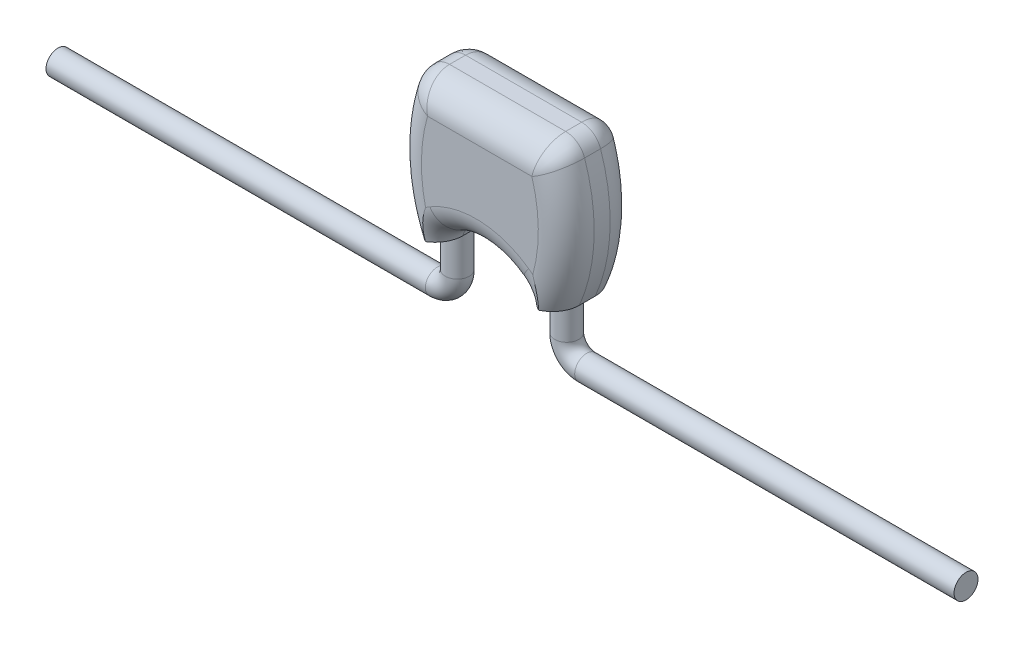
ISO-10303-21;
HEADER;
FILE_DESCRIPTION(('STEP AP214'),'2;1');
FILE_NAME('part.step','',(''),(''),'','','');
FILE_SCHEMA(('AUTOMOTIVE_DESIGN { 1 0 10303 214 1 1 1 1 }'));
ENDSEC;
DATA;
#1=APPLICATION_CONTEXT('core data for automotive mechanical design processes');
#2=APPLICATION_PROTOCOL_DEFINITION('international standard','automotive_design',2000,#1);
#3=PRODUCT_CONTEXT('',#1,'mechanical');
#4=PRODUCT('Part','Part','',(#3));
#5=PRODUCT_RELATED_PRODUCT_CATEGORY('part','',(#4));
#6=PRODUCT_DEFINITION_FORMATION('','',#4);
#7=PRODUCT_DEFINITION_CONTEXT('part definition',#1,'design');
#8=PRODUCT_DEFINITION('design','',#6,#7);
#9=PRODUCT_DEFINITION_SHAPE('','',#8);
#10=(LENGTH_UNIT() NAMED_UNIT(*) SI_UNIT(.MILLI.,.METRE.));
#11=(NAMED_UNIT(*) PLANE_ANGLE_UNIT() SI_UNIT($,.RADIAN.));
#12=(NAMED_UNIT(*) SI_UNIT($,.STERADIAN.) SOLID_ANGLE_UNIT());
#13=UNCERTAINTY_MEASURE_WITH_UNIT(LENGTH_MEASURE(1.E-05),#10,'distance_accuracy_value','');
#14=(GEOMETRIC_REPRESENTATION_CONTEXT(3) GLOBAL_UNCERTAINTY_ASSIGNED_CONTEXT((#13)) GLOBAL_UNIT_ASSIGNED_CONTEXT((#10,
#11,#12)) REPRESENTATION_CONTEXT('',''));
#15=CARTESIAN_POINT('',(0.,0.,0.));
#16=DIRECTION('',(0.,0.,1.));
#17=DIRECTION('',(1.,0.,0.));
#18=AXIS2_PLACEMENT_3D('',#15,#16,#17);
#19=CARTESIAN_POINT('',(7.81965093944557,9.55878093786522,1.8));
#20=DIRECTION('',(0.,1.,0.));
#21=DIRECTION('',(-1.,0.,0.));
#22=AXIS2_PLACEMENT_3D('',#19,#20,#21);
#23=PLANE('',#22);
#24=CARTESIAN_POINT('',(7.81965093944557,9.55878093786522,0.7));
#25=CARTESIAN_POINT('',(7.81960804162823,9.55878093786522,0.662717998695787));
#26=CARTESIAN_POINT('',(7.82285341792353,9.55878093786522,0.625459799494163));
#27=CARTESIAN_POINT('',(7.83558781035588,9.55878093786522,0.55211907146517));
#28=CARTESIAN_POINT('',(7.84506108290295,9.55878093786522,0.516033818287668));
#29=CARTESIAN_POINT('',(7.8699199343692,9.55878093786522,0.445972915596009));
#30=CARTESIAN_POINT('',(7.88530483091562,9.55878093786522,0.411997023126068));
#31=CARTESIAN_POINT('',(7.92141808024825,9.55878093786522,0.347014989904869));
#32=CARTESIAN_POINT('',(7.9421479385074,9.55878093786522,0.316009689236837));
#33=CARTESIAN_POINT('',(7.98886140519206,9.55878093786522,0.256924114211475));
#34=CARTESIAN_POINT('',(8.01496804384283,9.55878093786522,0.22894133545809));
#35=CARTESIAN_POINT('',(8.07124624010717,9.55878093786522,0.177421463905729));
#36=CARTESIAN_POINT('',(8.1014189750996,9.55878093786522,0.153885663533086));
#37=CARTESIAN_POINT('',(8.16710138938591,9.55878093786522,0.110226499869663));
#38=CARTESIAN_POINT('',(8.20283337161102,9.55878093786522,0.0904383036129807));
#39=CARTESIAN_POINT('',(8.27693019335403,9.55878093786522,0.0566251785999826));
#40=CARTESIAN_POINT('',(8.31529563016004,9.55878093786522,0.042601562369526));
#41=CARTESIAN_POINT('',(8.38200458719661,9.55878093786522,0.0237218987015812));
#42=CARTESIAN_POINT('',(8.409939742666,9.55878093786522,0.0173800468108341));
#43=CARTESIAN_POINT('',(8.46624296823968,9.55878093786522,0.00759900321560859));
#44=CARTESIAN_POINT('',(8.49460978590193,9.55878093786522,0.00415261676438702));
#45=CARTESIAN_POINT('',(8.52308072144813,9.55878093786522,0.00213820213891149));
#46=B_SPLINE_CURVE_WITH_KNOTS('',3,(#24,#25,#26,#27,#28,#29,#30,#31,#32,#33,#34,#35,#36,#37,#38,
#39,#40,#41,#42,#43,#44,#45),.UNSPECIFIED.,.F.,.F.,(4,2,2,2,2,2,2,2,2,2,4),(0.,
0.111668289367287,0.223055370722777,0.334429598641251,0.445835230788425,0.560149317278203,
0.674496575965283,0.796520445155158,0.91857208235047,1.00436771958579,1.08994953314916),.UNSPECIFIED.);
#47=CARTESIAN_POINT('',(7.81965093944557,9.55878093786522,0.7));
#48=VERTEX_POINT('',#47);
#49=CARTESIAN_POINT('',(8.18237882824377,9.55878093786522,0.102697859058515));
#50=VERTEX_POINT('',#49);
#51=EDGE_CURVE('E299',#48,#50,#46,.T.);
#52=ORIENTED_EDGE('',*,*,#51,.T.);
#53=CARTESIAN_POINT('',(7.81965093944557,9.55878093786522,1.64894267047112E-05));
#54=CARTESIAN_POINT('',(7.85957849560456,9.55878093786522,0.000255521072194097));
#55=CARTESIAN_POINT('',(7.89946846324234,9.55878093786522,0.00394266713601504));
#56=CARTESIAN_POINT('',(7.97803145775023,9.55878093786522,0.0179330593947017));
#57=CARTESIAN_POINT('',(8.01670566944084,9.55878093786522,0.028229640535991));
#58=CARTESIAN_POINT('',(8.09179291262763,9.55878093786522,0.0551649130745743));
#59=CARTESIAN_POINT('',(8.12820517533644,9.55878093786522,0.0718057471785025));
#60=CARTESIAN_POINT('',(8.19773489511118,9.55878093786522,0.110933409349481));
#61=CARTESIAN_POINT('',(8.23085259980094,9.55878093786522,0.13341979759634));
#62=CARTESIAN_POINT('',(8.29300365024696,9.55878093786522,0.183716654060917));
#63=CARTESIAN_POINT('',(8.32201862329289,9.55878093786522,0.211549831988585));
#64=CARTESIAN_POINT('',(8.37496245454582,9.55878093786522,0.271710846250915));
#65=CARTESIAN_POINT('',(8.39888992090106,9.55878093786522,0.304039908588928));
#66=CARTESIAN_POINT('',(8.44086868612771,9.55878093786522,0.37221171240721));
#67=CARTESIAN_POINT('',(8.45893288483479,9.55878093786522,0.408046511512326));
#68=CARTESIAN_POINT('',(8.48863140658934,9.55878093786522,0.482269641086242));
#69=CARTESIAN_POINT('',(8.50027247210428,9.55878093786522,0.520655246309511));
#70=CARTESIAN_POINT('',(8.51333121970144,9.55878093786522,0.582793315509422));
#71=CARTESIAN_POINT('',(8.51698343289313,9.55878093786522,0.606097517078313));
#72=CARTESIAN_POINT('',(8.52185832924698,9.55878093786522,0.652930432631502));
#73=CARTESIAN_POINT('',(8.52308389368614,9.55878093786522,0.676458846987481));
#74=CARTESIAN_POINT('',(8.52308072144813,9.55878093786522,0.7));
#75=B_SPLINE_CURVE_WITH_KNOTS('',3,(#53,#54,#55,#56,#57,#58,#59,#60,#61,#62,#63,#64,#65,#66,#67,
#68,#69,#70,#71,#72,#73,#74),.UNSPECIFIED.,.F.,.F.,(4,2,2,2,2,2,2,2,2,2,4),(0.,
0.119618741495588,0.23911704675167,0.358655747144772,0.47818545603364,0.598234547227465,
0.718316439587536,0.838132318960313,0.957822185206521,1.02847312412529,1.09904012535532),.UNSPECIFIED.);
#76=CARTESIAN_POINT('',(8.52308072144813,9.55878093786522,0.7));
#77=VERTEX_POINT('',#76);
#78=EDGE_CURVE('E318',#50,#77,#75,.T.);
#79=ORIENTED_EDGE('',*,*,#78,.T.);
#80=DIRECTION('',(0.,0.,-1.));
#81=VECTOR('',#80,1.);
#82=CARTESIAN_POINT('',(8.52308072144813,9.55878093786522,1.8));
#83=LINE('',#82,#81);
#84=CARTESIAN_POINT('',(8.52308072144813,9.55878093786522,1.1));
#85=VERTEX_POINT('',#84);
#86=EDGE_CURVE('E474',#85,#77,#83,.T.);
#87=ORIENTED_EDGE('',*,*,#86,.F.);
#88=CARTESIAN_POINT('',(8.52308072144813,9.55878093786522,1.1));
#89=CARTESIAN_POINT('',(8.52308137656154,9.55878093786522,1.12137101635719));
#90=CARTESIAN_POINT('',(8.52207289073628,9.55878093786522,1.14272845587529));
#91=CARTESIAN_POINT('',(8.51805834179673,9.55878093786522,1.1852517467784));
#92=CARTESIAN_POINT('',(8.51505256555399,9.55878093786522,1.20641762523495));
#93=CARTESIAN_POINT('',(8.50310220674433,9.55878093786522,1.26922084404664));
#94=CARTESIAN_POINT('',(8.4912242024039,9.55878093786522,1.31033914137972));
#95=CARTESIAN_POINT('',(8.46165375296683,9.55878093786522,1.38587993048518));
#96=CARTESIAN_POINT('',(8.4446235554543,9.55878093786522,1.42056705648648));
#97=CARTESIAN_POINT('',(8.40512741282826,9.55878093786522,1.48670473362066));
#98=CARTESIAN_POINT('',(8.38266105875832,9.55878093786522,1.51815504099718));
#99=CARTESIAN_POINT('',(8.3322750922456,9.55878093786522,1.57777999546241));
#100=CARTESIAN_POINT('',(8.30422699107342,9.55878093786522,1.60584603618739));
#101=CARTESIAN_POINT('',(8.24386275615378,9.55878093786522,1.65695450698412));
#102=CARTESIAN_POINT('',(8.21154537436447,9.55878093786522,1.67999546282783));
#103=CARTESIAN_POINT('',(8.14308704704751,9.55878093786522,1.72067756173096));
#104=CARTESIAN_POINT('',(8.10690066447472,9.55878093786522,1.73824220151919));
#105=CARTESIAN_POINT('',(8.03210171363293,9.55878093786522,1.7670229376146));
#106=CARTESIAN_POINT('',(7.99349121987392,9.55878093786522,1.7782443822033));
#107=CARTESIAN_POINT('',(7.93207703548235,9.55878093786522,1.79058229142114));
#108=CARTESIAN_POINT('',(7.90970645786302,9.55878093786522,1.79397110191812));
#109=CARTESIAN_POINT('',(7.86478015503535,9.55878093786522,1.79859332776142));
#110=CARTESIAN_POINT('',(7.84222478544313,9.55878093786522,1.79983020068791));
#111=CARTESIAN_POINT('',(7.81965093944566,9.55878093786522,1.79998351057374));
#112=B_SPLINE_CURVE_WITH_KNOTS('',3,(#88,#89,#90,#91,#92,#93,#94,#95,#96,#97,#98,#99,#100,#101,
#102,#103,#104,#105,#106,#107,#108,#109,#110,#111),.UNSPECIFIED.,.F.,.F.,(4,2,2,2,2,2,2,2,2,2,2,
4),(0.,0.0640626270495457,0.128116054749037,0.255704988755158,0.37113068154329,
0.486565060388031,0.605051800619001,0.723573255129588,0.843683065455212,0.963691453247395,
1.03147594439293,1.09915142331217),.UNSPECIFIED.);
#113=CARTESIAN_POINT('',(8.18237882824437,9.55878093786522,1.69730214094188));
#114=VERTEX_POINT('',#113);
#115=EDGE_CURVE('E294',#85,#114,#112,.T.);
#116=ORIENTED_EDGE('',*,*,#115,.T.);
#117=CARTESIAN_POINT('',(8.52308072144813,9.55878093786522,1.79786179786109));
#118=CARTESIAN_POINT('',(8.47758492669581,9.55878093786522,1.79466827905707));
#119=CARTESIAN_POINT('',(8.43230786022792,9.55878093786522,1.78776781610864));
#120=CARTESIAN_POINT('',(8.34336461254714,9.55878093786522,1.7665806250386));
#121=CARTESIAN_POINT('',(8.29970425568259,9.55878093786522,1.75226953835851));
#122=CARTESIAN_POINT('',(8.21538266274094,9.55878093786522,1.71626631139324));
#123=CARTESIAN_POINT('',(8.17472907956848,9.55878093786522,1.69455607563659));
#124=CARTESIAN_POINT('',(8.09807124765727,9.55878093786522,1.64415314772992));
#125=CARTESIAN_POINT('',(8.06205945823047,9.55878093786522,1.61547200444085));
#126=CARTESIAN_POINT('',(7.99841432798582,9.55878093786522,1.55402429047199));
#127=CARTESIAN_POINT('',(7.97037184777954,9.55878093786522,1.52168207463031));
#128=CARTESIAN_POINT('',(7.92067729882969,9.55878093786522,1.45237016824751));
#129=CARTESIAN_POINT('',(7.89902672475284,9.55878093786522,1.41539939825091));
#130=CARTESIAN_POINT('',(7.86457487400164,9.55878093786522,1.34117144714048));
#131=CARTESIAN_POINT('',(7.85119875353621,9.55878093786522,1.30418014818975));
#132=CARTESIAN_POINT('',(7.83126752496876,9.55878093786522,1.22846845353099));
#133=CARTESIAN_POINT('',(7.82469603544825,9.55878093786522,1.18975244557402));
#134=CARTESIAN_POINT('',(7.82030988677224,9.55878093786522,1.13389311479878));
#135=CARTESIAN_POINT('',(7.81964414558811,9.55878093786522,1.11694141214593));
#136=CARTESIAN_POINT('',(7.81965093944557,9.55878093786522,1.1));
#137=B_SPLINE_CURVE_WITH_KNOTS('',3,(#117,#118,#119,#120,#121,#122,#123,#124,#125,#126,#127,
#128,#129,#130,#131,#132,#133,#134,#135,#136),.UNSPECIFIED.,.F.,.F.,(4,2,2,2,2,2,2,2,2,4),(0.,
0.136742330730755,0.273937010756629,0.411469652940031,0.54877597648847,0.676507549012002,
0.804268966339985,0.921679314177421,1.03880634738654,1.0896455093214),.UNSPECIFIED.);
#138=CARTESIAN_POINT('',(7.81965093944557,9.55878093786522,1.1));
#139=VERTEX_POINT('',#138);
#140=EDGE_CURVE('E300',#114,#139,#137,.T.);
#141=ORIENTED_EDGE('',*,*,#140,.T.);
#142=DIRECTION('',(0.,0.,-1.));
#143=VECTOR('',#142,1.);
#144=CARTESIAN_POINT('',(7.81965093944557,9.55878093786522,1.8));
#145=LINE('',#144,#143);
#146=EDGE_CURVE('E461',#139,#48,#145,.T.);
#147=ORIENTED_EDGE('',*,*,#146,.T.);
#148=EDGE_LOOP('',(#52,#79,#87,#116,#141,#147));
#149=FACE_BOUND('',#148,.T.);
#150=CARTESIAN_POINT('',(8.18237882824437,9.55878093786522,0.9));
#151=DIRECTION('',(0.,-1.,0.));
#152=DIRECTION('',(1.,0.,0.));
#153=AXIS2_PLACEMENT_3D('',#150,#151,#152);
#154=CIRCLE('',#153,0.3);
#155=CARTESIAN_POINT('',(8.48237882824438,9.55878093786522,0.9));
#156=VERTEX_POINT('',#155);
#157=EDGE_CURVE('E197',#156,#156,#154,.T.);
#158=ORIENTED_EDGE('',*,*,#157,.F.);
#159=EDGE_LOOP('',(#158));
#160=FACE_BOUND('',#159,.T.);
#161=ADVANCED_FACE('F32',(#149,#160),#23,.F.);
#162=CARTESIAN_POINT('',(12.2164509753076,11.3078955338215,1.8));
#163=DIRECTION('',(0.,0.,-1.));
#164=DIRECTION('',(-1.,0.,0.));
#165=AXIS2_PLACEMENT_3D('',#162,#163,#164);
#166=CYLINDRICAL_SURFACE('',#165,4.73193960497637);
#167=DIRECTION('',(0.,0.,-1.));
#168=VECTOR('',#167,1.);
#169=CARTESIAN_POINT('',(7.71330571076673,12.7614894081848,1.8));
#170=LINE('',#169,#168);
#171=CARTESIAN_POINT('',(7.71330571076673,12.7614894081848,1.1));
#172=VERTEX_POINT('',#171);
#173=CARTESIAN_POINT('',(7.71330571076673,12.7614894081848,0.7));
#174=VERTEX_POINT('',#173);
#175=EDGE_CURVE('E609',#172,#174,#170,.T.);
#176=ORIENTED_EDGE('',*,*,#175,.T.);
#177=CARTESIAN_POINT('',(12.2164509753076,11.3078955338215,0.7));
#178=DIRECTION('',(0.,0.,1.));
#179=DIRECTION('',(1.,0.,0.));
#180=AXIS2_PLACEMENT_3D('',#177,#178,#179);
#181=CIRCLE('',#180,4.73193960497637);
#182=EDGE_CURVE('E472',#174,#48,#181,.T.);
#183=ORIENTED_EDGE('',*,*,#182,.T.);
#184=ORIENTED_EDGE('',*,*,#146,.F.);
#185=CARTESIAN_POINT('',(12.2164509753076,11.3078955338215,1.1));
#186=DIRECTION('',(0.,0.,1.));
#187=DIRECTION('',(1.,0.,0.));
#188=AXIS2_PLACEMENT_3D('',#185,#186,#187);
#189=CIRCLE('',#188,4.73193960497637);
#190=EDGE_CURVE('E469',#139,#172,#189,.F.);
#191=ORIENTED_EDGE('',*,*,#190,.T.);
#192=EDGE_LOOP('',(#176,#183,#184,#191));
#193=FACE_BOUND('',#192,.T.);
#194=ADVANCED_FACE('F34',(#193),#166,.T.);
#195=CARTESIAN_POINT('',(9.00904138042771,9.44112789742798,1.8));
#196=DIRECTION('',(0.,0.,-1.));
#197=DIRECTION('',(-1.,0.,0.));
#198=AXIS2_PLACEMENT_3D('',#195,#196,#197);
#199=CYLINDRICAL_SURFACE('',#198,0.5);
#200=ORIENTED_EDGE('',*,*,#86,.T.);
#201=CARTESIAN_POINT('',(9.00904138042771,9.44112789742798,0.7));
#202=DIRECTION('',(0.,0.,1.));
#203=DIRECTION('',(1.,0.,0.));
#204=AXIS2_PLACEMENT_3D('',#201,#202,#203);
#205=CIRCLE('',#204,0.5);
#206=CARTESIAN_POINT('',(8.75298333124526,9.87058601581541,0.7));
#207=VERTEX_POINT('',#206);
#208=EDGE_CURVE('E519',#77,#207,#205,.F.);
#209=ORIENTED_EDGE('',*,*,#208,.T.);
#210=DIRECTION('',(0.,0.,-1.));
#211=VECTOR('',#210,1.);
#212=CARTESIAN_POINT('',(8.75298333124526,9.87058601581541,1.8));
#213=LINE('',#212,#211);
#214=CARTESIAN_POINT('',(8.75298333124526,9.87058601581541,1.1));
#215=VERTEX_POINT('',#214);
#216=EDGE_CURVE('E508',#215,#207,#213,.T.);
#217=ORIENTED_EDGE('',*,*,#216,.F.);
#218=CARTESIAN_POINT('',(9.00904138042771,9.44112789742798,1.1));
#219=DIRECTION('',(0.,0.,1.));
#220=DIRECTION('',(1.,0.,0.));
#221=AXIS2_PLACEMENT_3D('',#218,#219,#220);
#222=CIRCLE('',#221,0.5);
#223=EDGE_CURVE('E473',#215,#85,#222,.T.);
#224=ORIENTED_EDGE('',*,*,#223,.T.);
#225=EDGE_LOOP('',(#200,#209,#217,#224));
#226=FACE_BOUND('',#225,.T.);
#227=ADVANCED_FACE('F314',(#226),#199,.F.);
#228=CARTESIAN_POINT('',(9.5527512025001,8.52922296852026,1.8));
#229=DIRECTION('',(0.,0.,-1.));
#230=DIRECTION('',(-1.,0.,0.));
#231=AXIS2_PLACEMENT_3D('',#228,#229,#230);
#232=CYLINDRICAL_SURFACE('',#231,1.56169250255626);
#233=ORIENTED_EDGE('',*,*,#216,.T.);
#234=CARTESIAN_POINT('',(9.5527512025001,8.52922296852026,0.7));
#235=DIRECTION('',(0.,0.,1.));
#236=DIRECTION('',(1.,0.,0.));
#237=AXIS2_PLACEMENT_3D('',#234,#235,#236);
#238=CIRCLE('',#237,1.56169250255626);
#239=CARTESIAN_POINT('',(10.460612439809,9.79992019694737,0.7));
#240=VERTEX_POINT('',#239);
#241=EDGE_CURVE('E538',#207,#240,#238,.F.);
#242=ORIENTED_EDGE('',*,*,#241,.T.);
#243=DIRECTION('',(0.,0.,-1.));
#244=VECTOR('',#243,1.);
#245=CARTESIAN_POINT('',(10.460612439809,9.79992019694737,1.8));
#246=LINE('',#245,#244);
#247=CARTESIAN_POINT('',(10.460612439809,9.79992019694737,1.1));
#248=VERTEX_POINT('',#247);
#249=EDGE_CURVE('E505',#248,#240,#246,.T.);
#250=ORIENTED_EDGE('',*,*,#249,.F.);
#251=CARTESIAN_POINT('',(9.5527512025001,8.52922296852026,1.1));
#252=DIRECTION('',(0.,0.,1.));
#253=DIRECTION('',(1.,0.,0.));
#254=AXIS2_PLACEMENT_3D('',#251,#252,#253);
#255=CIRCLE('',#254,1.56169250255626);
#256=EDGE_CURVE('E324',#248,#215,#255,.T.);
#257=ORIENTED_EDGE('',*,*,#256,.T.);
#258=EDGE_LOOP('',(#233,#242,#250,#257));
#259=FACE_BOUND('',#258,.T.);
#260=ADVANCED_FACE('F869',(#259),#232,.F.);
#261=CARTESIAN_POINT('',(10.1699466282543,9.3930868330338,1.8));
#262=DIRECTION('',(0.,0.,-1.));
#263=DIRECTION('',(-1.,0.,0.));
#264=AXIS2_PLACEMENT_3D('',#261,#262,#263);
#265=CYLINDRICAL_SURFACE('',#264,0.500000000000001);
#266=DIRECTION('',(0.,0.,-1.));
#267=VECTOR('',#266,1.);
#268=CARTESIAN_POINT('',(10.6416938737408,9.55878093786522,1.8));
#269=LINE('',#268,#267);
#270=CARTESIAN_POINT('',(10.6416938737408,9.55878093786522,1.00391017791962));
#271=VERTEX_POINT('',#270);
#272=CARTESIAN_POINT('',(10.6416938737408,9.55878093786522,0.796089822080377));
#273=VERTEX_POINT('',#272);
#274=EDGE_CURVE('E11',#271,#273,#269,.T.);
#275=ORIENTED_EDGE('',*,*,#274,.F.);
#276=CARTESIAN_POINT('',(10.6416938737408,9.55878093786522,1.00391017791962));
#277=CARTESIAN_POINT('',(10.6448538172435,9.54984722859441,1.01240472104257));
#278=CARTESIAN_POINT('',(10.6480067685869,9.54000095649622,1.01982267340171));
#279=CARTESIAN_POINT('',(10.6539302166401,9.51906824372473,1.03261820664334));
#280=CARTESIAN_POINT('',(10.6567037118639,9.50799295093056,1.03801245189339));
#281=CARTESIAN_POINT('',(10.66154804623,9.48509765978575,1.04698032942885));
#282=CARTESIAN_POINT('',(10.6636235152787,9.47328321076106,1.05056604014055));
#283=CARTESIAN_POINT('',(10.6669431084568,9.44914858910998,1.05614816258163));
#284=CARTESIAN_POINT('',(10.6681853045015,9.4368273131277,1.05814089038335));
#285=CARTESIAN_POINT('',(10.6698330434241,9.41056960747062,1.06076903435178));
#286=CARTESIAN_POINT('',(10.6701279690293,9.39660822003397,1.06122528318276));
#287=CARTESIAN_POINT('',(10.669548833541,9.36876012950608,1.06031241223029));
#288=CARTESIAN_POINT('',(10.6686739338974,9.35487348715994,1.058941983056));
#289=CARTESIAN_POINT('',(10.6657109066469,9.32647856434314,1.05410285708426));
#290=CARTESIAN_POINT('',(10.6635344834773,9.31200484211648,1.0504806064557));
#291=CARTESIAN_POINT('',(10.658134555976,9.28412588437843,1.04075437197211));
#292=CARTESIAN_POINT('',(10.6549135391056,9.27071820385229,1.0346562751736));
#293=CARTESIAN_POINT('',(10.6491630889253,9.25018047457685,1.02236579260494));
#294=CARTESIAN_POINT('',(10.6467968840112,9.24251730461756,1.01698318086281));
#295=CARTESIAN_POINT('',(10.6420349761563,9.22819554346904,1.00502628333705));
#296=CARTESIAN_POINT('',(10.6396393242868,9.22153542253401,0.99845384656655));
#297=CARTESIAN_POINT('',(10.6354316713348,9.21045814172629,0.985283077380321));
#298=CARTESIAN_POINT('',(10.6335873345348,9.20585279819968,0.978853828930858));
#299=CARTESIAN_POINT('',(10.6302238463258,9.19773013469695,0.965258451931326));
#300=CARTESIAN_POINT('',(10.6287046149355,9.19421254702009,0.958092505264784));
#301=CARTESIAN_POINT('',(10.6261451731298,9.18840870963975,0.94314567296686));
#302=CARTESIAN_POINT('',(10.6251076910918,9.18612946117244,0.935361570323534));
#303=CARTESIAN_POINT('',(10.6236492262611,9.18295087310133,0.919460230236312));
#304=CARTESIAN_POINT('',(10.6232279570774,9.18205089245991,0.911343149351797));
#305=CARTESIAN_POINT('',(10.6230623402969,9.18169594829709,0.895898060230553));
#306=CARTESIAN_POINT('',(10.6232536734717,9.18210369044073,0.888573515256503));
#307=CARTESIAN_POINT('',(10.6241549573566,9.18405111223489,0.874111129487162));
#308=CARTESIAN_POINT('',(10.624864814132,9.18559058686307,0.866973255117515));
#309=CARTESIAN_POINT('',(10.6267186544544,9.18970479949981,0.853182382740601));
#310=CARTESIAN_POINT('',(10.6278560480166,9.19226385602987,0.846523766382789));
#311=CARTESIAN_POINT('',(10.6304638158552,9.19831839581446,0.833720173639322));
#312=CARTESIAN_POINT('',(10.6319342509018,9.20181404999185,0.827575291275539));
#313=CARTESIAN_POINT('',(10.635226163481,9.20995912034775,0.815393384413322));
#314=CARTESIAN_POINT('',(10.6370669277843,9.21468175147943,0.809410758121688));
#315=CARTESIAN_POINT('',(10.6408540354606,9.22493164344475,0.798221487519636));
#316=CARTESIAN_POINT('',(10.6428004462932,9.23045942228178,0.793015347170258));
#317=CARTESIAN_POINT('',(10.6475109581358,9.24472828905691,0.781284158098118));
#318=CARTESIAN_POINT('',(10.6502608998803,9.25381835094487,0.775176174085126));
#319=CARTESIAN_POINT('',(10.6554025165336,9.27295600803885,0.764498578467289));
#320=CARTESIAN_POINT('',(10.6577934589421,9.28300549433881,0.759932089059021));
#321=CARTESIAN_POINT('',(10.6625274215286,9.30627199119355,0.751272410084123));
#322=CARTESIAN_POINT('',(10.6647167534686,9.31966407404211,0.747565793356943));
#323=CARTESIAN_POINT('',(10.668005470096,9.34696611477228,0.742124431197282));
#324=CARTESIAN_POINT('',(10.6691042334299,9.36087636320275,0.740390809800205));
#325=CARTESIAN_POINT('',(10.6701289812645,9.38897012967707,0.738771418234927));
#326=CARTESIAN_POINT('',(10.6700443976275,9.40315497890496,0.738902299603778));
#327=CARTESIAN_POINT('',(10.668681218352,9.43132932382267,0.741063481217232));
#328=CARTESIAN_POINT('',(10.6674024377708,9.44531878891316,0.743094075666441));
#329=CARTESIAN_POINT('',(10.6639724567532,9.47111102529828,0.748836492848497));
#330=CARTESIAN_POINT('',(10.661939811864,9.48297907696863,0.752325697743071));
#331=CARTESIAN_POINT('',(10.6571958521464,9.50588724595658,0.76105000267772));
#332=CARTESIAN_POINT('',(10.6544868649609,9.51693003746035,0.766279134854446));
#333=CARTESIAN_POINT('',(10.650006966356,9.53300418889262,0.775819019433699));
#334=CARTESIAN_POINT('',(10.6483729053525,9.5384770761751,0.779457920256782));
#335=CARTESIAN_POINT('',(10.6450538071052,9.54898374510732,0.78732636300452));
#336=CARTESIAN_POINT('',(10.6433686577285,9.55401644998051,0.79155729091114));
#337=CARTESIAN_POINT('',(10.6416938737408,9.55878093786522,0.796089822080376));
#338=B_SPLINE_CURVE_WITH_KNOTS('',3,(#276,#277,#278,#279,#280,#281,#282,#283,#284,#285,#286,
#287,#288,#289,#290,#291,#292,#293,#294,#295,#296,#297,#298,#299,#300,#301,#302,#303,#304,#305,
#306,#307,#308,#309,#310,#311,#312,#313,#314,#315,#316,#317,#318,#319,#320,#321,#322,#323,#324,
#325,#326,#327,#328,#329,#330,#331,#332,#333,#334,#335,#336,#337),.UNSPECIFIED.,.F.,.F.,(4,2,2,
2,2,2,2,2,2,2,2,2,2,2,2,2,2,2,2,2,2,2,2,2,2,2,2,2,2,2,4),(0.,0.0379887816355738,
0.0756574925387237,0.113071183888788,0.150571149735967,0.192315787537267,0.234090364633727,
0.279084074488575,0.323971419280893,0.352844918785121,0.381673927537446,0.405935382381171,
0.430190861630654,0.454582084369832,0.478961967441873,0.500869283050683,0.522772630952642,
0.544351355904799,0.565934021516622,0.589366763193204,0.61281464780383,0.646503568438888,
0.68026032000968,0.722243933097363,0.76425145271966,0.806634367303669,0.849023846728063,
0.886490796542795,0.923830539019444,0.944111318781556,0.964440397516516),.UNSPECIFIED.);
#339=CARTESIAN_POINT('',(10.6565871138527,9.50789553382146,1.03768920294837));
#340=VERTEX_POINT('',#339);
#341=EDGE_CURVE('E168',#271,#340,#338,.T.);
#342=ORIENTED_EDGE('',*,*,#341,.T.);
#343=DIRECTION('',(0.,0.,-1.));
#344=VECTOR('',#343,1.);
#345=CARTESIAN_POINT('',(10.6565871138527,9.50789553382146,1.8));
#346=LINE('',#345,#344);
#347=CARTESIAN_POINT('',(10.6565871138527,9.50789553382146,1.1));
#348=VERTEX_POINT('',#347);
#349=EDGE_CURVE('E501',#348,#340,#346,.T.);
#350=ORIENTED_EDGE('',*,*,#349,.F.);
#351=CARTESIAN_POINT('',(10.1699466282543,9.3930868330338,1.1));
#352=DIRECTION('',(0.,0.,1.));
#353=DIRECTION('',(1.,0.,0.));
#354=AXIS2_PLACEMENT_3D('',#351,#352,#353);
#355=CIRCLE('',#354,0.500000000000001);
#356=EDGE_CURVE('E542',#348,#248,#355,.T.);
#357=ORIENTED_EDGE('',*,*,#356,.T.);
#358=ORIENTED_EDGE('',*,*,#249,.T.);
#359=CARTESIAN_POINT('',(10.1699466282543,9.3930868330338,0.7));
#360=DIRECTION('',(0.,0.,1.));
#361=DIRECTION('',(1.,0.,0.));
#362=AXIS2_PLACEMENT_3D('',#359,#360,#361);
#363=CIRCLE('',#362,0.500000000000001);
#364=CARTESIAN_POINT('',(10.6565871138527,9.50789553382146,0.7));
#365=VERTEX_POINT('',#364);
#366=EDGE_CURVE('E543',#240,#365,#363,.F.);
#367=ORIENTED_EDGE('',*,*,#366,.T.);
#368=CARTESIAN_POINT('',(10.6565871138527,9.50789553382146,0.762310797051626));
#369=VERTEX_POINT('',#368);
#370=EDGE_CURVE('E185',#369,#365,#346,.T.);
#371=ORIENTED_EDGE('',*,*,#370,.F.);
#372=EDGE_CURVE('E47',#369,#273,#338,.T.);
#373=ORIENTED_EDGE('',*,*,#372,.T.);
#374=EDGE_LOOP('',(#275,#342,#350,#357,#358,#367,#371,#373));
#375=FACE_BOUND('',#374,.T.);
#376=ADVANCED_FACE('F182',(#375),#265,.F.);
#377=CARTESIAN_POINT('',(10.6565871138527,9.50789553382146,1.8));
#378=DIRECTION('',(0.,1.,0.));
#379=DIRECTION('',(-1.,0.,0.));
#380=AXIS2_PLACEMENT_3D('',#377,#378,#379);
#381=PLANE('',#380);
#382=ORIENTED_EDGE('',*,*,#349,.T.);
#383=CARTESIAN_POINT('',(10.9231235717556,9.50789553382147,0.9));
#384=DIRECTION('',(0.,1.,0.));
#385=DIRECTION('',(-1.,0.,0.));
#386=AXIS2_PLACEMENT_3D('',#383,#384,#385);
#387=CIRCLE('',#386,0.3);
#388=EDGE_CURVE('E40',#340,#369,#387,.T.);
#389=ORIENTED_EDGE('',*,*,#388,.T.);
#390=ORIENTED_EDGE('',*,*,#370,.T.);
#391=CARTESIAN_POINT('',(10.6565871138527,9.50789553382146,0.7));
#392=CARTESIAN_POINT('',(10.6565865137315,9.50789553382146,0.678630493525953));
#393=CARTESIAN_POINT('',(10.6575933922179,9.50789553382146,0.657274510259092));
#394=CARTESIAN_POINT('',(10.6616019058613,9.50789553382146,0.614753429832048));
#395=CARTESIAN_POINT('',(10.6646032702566,9.50789553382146,0.593588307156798));
#396=CARTESIAN_POINT('',(10.6765370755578,9.50789553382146,0.530785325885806));
#397=CARTESIAN_POINT('',(10.6883996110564,9.50789553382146,0.489665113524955));
#398=CARTESIAN_POINT('',(10.7179540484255,9.50789553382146,0.414077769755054));
#399=CARTESIAN_POINT('',(10.7349902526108,9.50789553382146,0.379348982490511));
#400=CARTESIAN_POINT('',(10.7745130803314,9.50789553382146,0.313132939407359));
#401=CARTESIAN_POINT('',(10.7970003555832,9.50789553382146,0.281646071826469));
#402=CARTESIAN_POINT('',(10.8474119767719,9.50789553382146,0.221995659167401));
#403=CARTESIAN_POINT('',(10.8754590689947,9.50789553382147,0.193935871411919));
#404=CARTESIAN_POINT('',(10.935816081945,9.50789553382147,0.142849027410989));
#405=CARTESIAN_POINT('',(10.9681263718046,9.50789553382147,0.11982240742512));
#406=CARTESIAN_POINT('',(11.0365424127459,9.50789553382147,0.0791896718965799));
#407=CARTESIAN_POINT('',(11.0726905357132,9.50789553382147,0.0616548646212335));
#408=CARTESIAN_POINT('',(11.1474214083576,9.50789553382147,0.0329127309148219));
#409=CARTESIAN_POINT('',(11.1860039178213,9.50789553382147,0.0217047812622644));
#410=CARTESIAN_POINT('',(11.2605542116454,9.50789553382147,0.00675054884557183));
#411=CARTESIAN_POINT('',(11.2963958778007,9.50789553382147,0.00236837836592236));
#412=CARTESIAN_POINT('',(11.3683327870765,9.50789553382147,-0.000911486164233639));
#413=CARTESIAN_POINT('',(11.4044280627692,9.50789553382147,0.000191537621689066));
#414=CARTESIAN_POINT('',(11.4402365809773,9.50789553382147,0.00408000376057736));
#415=B_SPLINE_CURVE_WITH_KNOTS('',3,(#391,#392,#393,#394,#395,#396,#397,#398,#399,#400,#401,
#402,#403,#404,#405,#406,#407,#408,#409,#410,#411,#412,#413,#414),.UNSPECIFIED.,.F.,.F.,(4,2,2,
2,2,2,2,2,2,2,2,4),(0.,0.0640582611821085,0.12810782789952,0.255690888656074,0.371234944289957,
0.486792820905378,0.605263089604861,0.723743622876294,0.843704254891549,0.963653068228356,
1.07156559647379,1.17949224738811),.UNSPECIFIED.);
#416=CARTESIAN_POINT('',(11.0331478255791,9.50789553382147,0.0822386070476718));
#417=VERTEX_POINT('',#416);
#418=EDGE_CURVE('E572',#365,#417,#415,.T.);
#419=ORIENTED_EDGE('',*,*,#418,.T.);
#420=CARTESIAN_POINT('',(10.6565871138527,9.50789553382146,3.76062043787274E-05));
#421=CARTESIAN_POINT('',(10.7044802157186,9.50789553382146,-0.000424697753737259));
#422=CARTESIAN_POINT('',(10.752461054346,9.50789553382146,0.002996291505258));
#423=CARTESIAN_POINT('',(10.8473908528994,9.50789553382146,0.017717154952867));
#424=CARTESIAN_POINT('',(10.8943348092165,9.50789553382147,0.029049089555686));
#425=CARTESIAN_POINT('',(10.9856939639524,9.50789553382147,0.0597510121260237));
#426=CARTESIAN_POINT('',(11.0301019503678,9.50789553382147,0.0791427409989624));
#427=CARTESIAN_POINT('',(11.1145437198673,9.50789553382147,0.125742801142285));
#428=CARTESIAN_POINT('',(11.15458540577,9.50789553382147,0.152936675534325));
#429=CARTESIAN_POINT('',(11.2255459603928,9.50789553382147,0.212021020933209));
#430=CARTESIAN_POINT('',(11.2569469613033,9.50789553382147,0.243331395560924));
#431=CARTESIAN_POINT('',(11.3133468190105,9.50789553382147,0.311307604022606));
#432=CARTESIAN_POINT('',(11.3383462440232,9.50789553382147,0.347972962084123));
#433=CARTESIAN_POINT('',(11.378601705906,9.50789553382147,0.421613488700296));
#434=CARTESIAN_POINT('',(11.3945789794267,9.50789553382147,0.458195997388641));
#435=CARTESIAN_POINT('',(11.419627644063,9.50789553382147,0.53361943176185));
#436=CARTESIAN_POINT('',(11.4287126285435,9.50789553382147,0.572455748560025));
#437=CARTESIAN_POINT('',(11.4361803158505,9.50789553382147,0.626372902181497));
#438=CARTESIAN_POINT('',(11.4377014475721,9.50789553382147,0.641068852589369));
#439=CARTESIAN_POINT('',(11.439728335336,9.50789553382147,0.670507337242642));
#440=CARTESIAN_POINT('',(11.440235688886,9.50789553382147,0.685249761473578));
#441=CARTESIAN_POINT('',(11.4402365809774,9.50789553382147,0.699999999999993));
#442=B_SPLINE_CURVE_WITH_KNOTS('',3,(#420,#421,#422,#423,#424,#425,#426,#427,#428,#429,#430,
#431,#432,#433,#434,#435,#436,#437,#438,#439,#440,#441),.UNSPECIFIED.,.F.,.F.,(4,2,2,2,2,2,2,2,
2,2,4),(0.,0.143612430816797,0.287810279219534,0.432399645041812,0.576722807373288,
0.709021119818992,0.841307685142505,0.960451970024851,1.07936065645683,1.12365696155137,
1.16788340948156),.UNSPECIFIED.);
#443=CARTESIAN_POINT('',(11.4402365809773,9.50789553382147,0.7));
#444=VERTEX_POINT('',#443);
#445=EDGE_CURVE('E568',#417,#444,#442,.T.);
#446=ORIENTED_EDGE('',*,*,#445,.T.);
#447=DIRECTION('',(0.,0.,-1.));
#448=VECTOR('',#447,1.);
#449=CARTESIAN_POINT('',(11.4402365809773,9.50789553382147,1.8));
#450=LINE('',#449,#448);
#451=CARTESIAN_POINT('',(11.4402365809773,9.50789553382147,1.1));
#452=VERTEX_POINT('',#451);
#453=EDGE_CURVE('E510',#452,#444,#450,.T.);
#454=ORIENTED_EDGE('',*,*,#453,.F.);
#455=CARTESIAN_POINT('',(11.4402365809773,9.50789553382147,1.1));
#456=CARTESIAN_POINT('',(11.4402807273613,9.50789553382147,1.13696430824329));
#457=CARTESIAN_POINT('',(11.4370519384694,9.50789553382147,1.17390290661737));
#458=CARTESIAN_POINT('',(11.4243932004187,9.50789553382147,1.24659951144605));
#459=CARTESIAN_POINT('',(11.4149805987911,9.50789553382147,1.28236052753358));
#460=CARTESIAN_POINT('',(11.3902980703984,9.50789553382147,1.35178351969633));
#461=CARTESIAN_POINT('',(11.3750293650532,9.50789553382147,1.38544593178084));
#462=CARTESIAN_POINT('',(11.339214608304,9.50789553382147,1.44983870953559));
#463=CARTESIAN_POINT('',(11.3186664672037,9.50789553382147,1.48056790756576));
#464=CARTESIAN_POINT('',(11.2723182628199,9.50789553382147,1.5392568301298));
#465=CARTESIAN_POINT('',(11.2463809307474,9.50789553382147,1.56710786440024));
#466=CARTESIAN_POINT('',(11.1905019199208,9.50789553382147,1.61843171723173));
#467=CARTESIAN_POINT('',(11.160559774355,9.50789553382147,1.6419040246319));
#468=CARTESIAN_POINT('',(11.0951026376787,9.50789553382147,1.68574986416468));
#469=CARTESIAN_POINT('',(11.059336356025,9.50789553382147,1.70574763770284));
#470=CARTESIAN_POINT('',(10.9851495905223,9.50789553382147,1.74006257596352));
#471=CARTESIAN_POINT('',(10.9467263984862,9.50789553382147,1.75437384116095));
#472=CARTESIAN_POINT('',(10.8667620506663,9.50789553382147,1.77764991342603));
#473=CARTESIAN_POINT('',(10.8251581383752,9.50789553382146,1.78639746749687));
#474=CARTESIAN_POINT('',(10.7412103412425,9.50789553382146,1.79774744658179));
#475=CARTESIAN_POINT('',(10.6988683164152,9.50789553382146,1.8003635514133));
#476=CARTESIAN_POINT('',(10.6565871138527,9.50789553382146,1.79996239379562));
#477=B_SPLINE_CURVE_WITH_KNOTS('',3,(#455,#456,#457,#458,#459,#460,#461,#462,#463,#464,#465,
#466,#467,#468,#469,#470,#471,#472,#473,#474,#475,#476),.UNSPECIFIED.,.F.,.F.,(4,2,2,2,2,2,2,2,
2,2,4),(0.,0.110712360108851,0.221115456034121,0.331495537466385,0.441919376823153,
0.555606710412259,0.66930730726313,0.791728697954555,0.914276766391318,1.04135608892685,
1.1681516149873),.UNSPECIFIED.);
#478=CARTESIAN_POINT('',(11.0331478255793,9.50789553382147,1.71776139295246));
#479=VERTEX_POINT('',#478);
#480=EDGE_CURVE('E551',#452,#479,#477,.T.);
#481=ORIENTED_EDGE('',*,*,#480,.T.);
#482=CARTESIAN_POINT('',(11.4402365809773,9.50789553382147,1.79591999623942));
#483=CARTESIAN_POINT('',(11.4006324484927,9.50789553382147,1.8002314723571));
#484=CARTESIAN_POINT('',(11.3606725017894,9.50789553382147,1.80112029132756));
#485=CARTESIAN_POINT('',(11.2812074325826,9.50789553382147,1.79619937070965));
#486=CARTESIAN_POINT('',(11.2417018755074,9.50789553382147,1.79039668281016));
#487=CARTESIAN_POINT('',(11.164210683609,9.50789553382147,1.77224487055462));
#488=CARTESIAN_POINT('',(11.126225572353,9.50789553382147,1.75989351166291));
#489=CARTESIAN_POINT('',(11.052855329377,9.50789553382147,1.72902088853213));
#490=CARTESIAN_POINT('',(11.0174700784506,9.50789553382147,1.7104999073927));
#491=CARTESIAN_POINT('',(10.9501345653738,9.50789553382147,1.66772037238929));
#492=CARTESIAN_POINT('',(10.9182002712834,9.50789553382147,1.64343668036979));
#493=CARTESIAN_POINT('',(10.8588477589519,9.50789553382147,1.58985787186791));
#494=CARTESIAN_POINT('',(10.8314301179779,9.50789553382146,1.56056211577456));
#495=CARTESIAN_POINT('',(10.7818802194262,9.50789553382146,1.4977273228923));
#496=CARTESIAN_POINT('',(10.7597555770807,9.50789553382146,1.46418227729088));
#497=CARTESIAN_POINT('',(10.7215393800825,9.50789553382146,1.39382119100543));
#498=CARTESIAN_POINT('',(10.7054458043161,9.50789553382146,1.35700625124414));
#499=CARTESIAN_POINT('',(10.6807797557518,9.50789553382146,1.28388049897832));
#500=CARTESIAN_POINT('',(10.6717499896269,9.50789553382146,1.24772350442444));
#501=CARTESIAN_POINT('',(10.6596332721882,9.50789553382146,1.17438616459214));
#502=CARTESIAN_POINT('',(10.6565533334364,9.50789553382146,1.13720466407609));
#503=CARTESIAN_POINT('',(10.6565871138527,9.50789553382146,1.1));
#504=B_SPLINE_CURVE_WITH_KNOTS('',3,(#482,#483,#484,#485,#486,#487,#488,#489,#490,#491,#492,
#493,#494,#495,#496,#497,#498,#499,#500,#501,#502,#503),.UNSPECIFIED.,.F.,.F.,(4,2,2,2,2,2,2,2,
2,2,4),(0.,0.119348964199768,0.238572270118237,0.357836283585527,0.477094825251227,
0.596883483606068,0.716687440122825,0.836662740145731,0.956597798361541,1.06791589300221,
1.17936510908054),.UNSPECIFIED.);
#505=EDGE_CURVE('E503',#479,#348,#504,.T.);
#506=ORIENTED_EDGE('',*,*,#505,.T.);
#507=EDGE_LOOP('',(#382,#389,#390,#419,#446,#454,#481,#506));
#508=FACE_BOUND('',#507,.T.);
#509=ADVANCED_FACE('F500',(#508),#381,.F.);
#510=CARTESIAN_POINT('',(7.25966601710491,11.3078955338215,1.8));
#511=DIRECTION('',(0.,0.,-1.));
#512=DIRECTION('',(-1.,0.,0.));
#513=AXIS2_PLACEMENT_3D('',#510,#511,#512);
#514=CYLINDRICAL_SURFACE('',#513,4.55161182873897);
#515=ORIENTED_EDGE('',*,*,#453,.T.);
#516=CARTESIAN_POINT('',(7.25966601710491,11.3078955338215,0.7));
#517=DIRECTION('',(0.,0.,1.));
#518=DIRECTION('',(1.,0.,0.));
#519=AXIS2_PLACEMENT_3D('',#516,#517,#518);
#520=CIRCLE('',#519,4.55161182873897);
#521=CARTESIAN_POINT('',(11.5706188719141,12.7683255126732,0.7));
#522=VERTEX_POINT('',#521);
#523=EDGE_CURVE('E592',#444,#522,#520,.T.);
#524=ORIENTED_EDGE('',*,*,#523,.T.);
#525=DIRECTION('',(0.,0.,-1.));
#526=VECTOR('',#525,1.);
#527=CARTESIAN_POINT('',(11.5706188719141,12.7683255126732,1.8));
#528=LINE('',#527,#526);
#529=CARTESIAN_POINT('',(11.5706188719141,12.7683255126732,1.1));
#530=VERTEX_POINT('',#529);
#531=EDGE_CURVE('E618',#530,#522,#528,.T.);
#532=ORIENTED_EDGE('',*,*,#531,.F.);
#533=CARTESIAN_POINT('',(7.25966601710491,11.3078955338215,1.1));
#534=DIRECTION('',(0.,0.,1.));
#535=DIRECTION('',(1.,0.,0.));
#536=AXIS2_PLACEMENT_3D('',#533,#534,#535);
#537=CIRCLE('',#536,4.55161182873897);
#538=EDGE_CURVE('E577',#530,#452,#537,.F.);
#539=ORIENTED_EDGE('',*,*,#538,.T.);
#540=EDGE_LOOP('',(#515,#524,#532,#539));
#541=FACE_BOUND('',#540,.T.);
#542=ADVANCED_FACE('F562',(#541),#514,.T.);
#543=CARTESIAN_POINT('',(11.0970555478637,12.6078955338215,1.8));
#544=DIRECTION('',(0.,0.,-1.));
#545=DIRECTION('',(-1.,0.,0.));
#546=AXIS2_PLACEMENT_3D('',#543,#544,#545);
#547=CYLINDRICAL_SURFACE('',#546,0.5);
#548=ORIENTED_EDGE('',*,*,#531,.T.);
#549=CARTESIAN_POINT('',(11.0970555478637,12.6078955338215,0.7));
#550=DIRECTION('',(0.,0.,1.));
#551=DIRECTION('',(1.,0.,0.));
#552=AXIS2_PLACEMENT_3D('',#549,#550,#551);
#553=CIRCLE('',#552,0.5);
#554=CARTESIAN_POINT('',(11.0970555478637,13.1078955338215,0.7));
#555=VERTEX_POINT('',#554);
#556=EDGE_CURVE('E437',#522,#555,#553,.T.);
#557=ORIENTED_EDGE('',*,*,#556,.T.);
#558=DIRECTION('',(0.,0.,-1.));
#559=VECTOR('',#558,1.);
#560=CARTESIAN_POINT('',(11.0970555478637,13.1078955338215,1.8));
#561=LINE('',#560,#559);
#562=CARTESIAN_POINT('',(11.0970555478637,13.1078955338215,1.1));
#563=VERTEX_POINT('',#562);
#564=EDGE_CURVE('E616',#563,#555,#561,.T.);
#565=ORIENTED_EDGE('',*,*,#564,.F.);
#566=CARTESIAN_POINT('',(11.0970555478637,12.6078955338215,1.1));
#567=DIRECTION('',(0.,0.,-1.));
#568=DIRECTION('',(-1.,0.,0.));
#569=AXIS2_PLACEMENT_3D('',#566,#567,#568);
#570=CIRCLE('',#569,0.5);
#571=EDGE_CURVE('E596',#563,#530,#570,.T.);
#572=ORIENTED_EDGE('',*,*,#571,.T.);
#573=EDGE_LOOP('',(#548,#557,#565,#572));
#574=FACE_BOUND('',#573,.T.);
#575=ADVANCED_FACE('F845',(#574),#547,.T.);
#576=CARTESIAN_POINT('',(8.18913017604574,13.1078955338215,1.8));
#577=DIRECTION('',(0.,-1.,0.));
#578=DIRECTION('',(0.,0.,-1.));
#579=AXIS2_PLACEMENT_3D('',#576,#577,#578);
#580=PLANE('',#579);
#581=ORIENTED_EDGE('',*,*,#564,.T.);
#582=DIRECTION('',(-1.,0.,0.));
#583=VECTOR('',#582,1.);
#584=CARTESIAN_POINT('',(8.18913017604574,13.1078955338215,0.7));
#585=LINE('',#584,#583);
#586=CARTESIAN_POINT('',(8.18913017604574,13.1078955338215,0.7));
#587=VERTEX_POINT('',#586);
#588=EDGE_CURVE('E602',#555,#587,#585,.T.);
#589=ORIENTED_EDGE('',*,*,#588,.T.);
#590=DIRECTION('',(0.,0.,-1.));
#591=VECTOR('',#590,1.);
#592=CARTESIAN_POINT('',(8.18913017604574,13.1078955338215,1.8));
#593=LINE('',#592,#591);
#594=CARTESIAN_POINT('',(8.18913017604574,13.1078955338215,1.1));
#595=VERTEX_POINT('',#594);
#596=EDGE_CURVE('E608',#595,#587,#593,.T.);
#597=ORIENTED_EDGE('',*,*,#596,.F.);
#598=DIRECTION('',(-1.,0.,0.));
#599=VECTOR('',#598,1.);
#600=CARTESIAN_POINT('',(11.0970555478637,13.1078955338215,1.1));
#601=LINE('',#600,#599);
#602=EDGE_CURVE('E600',#595,#563,#601,.F.);
#603=ORIENTED_EDGE('',*,*,#602,.T.);
#604=EDGE_LOOP('',(#581,#589,#597,#603));
#605=FACE_BOUND('',#604,.T.);
#606=ADVANCED_FACE('F613',(#605),#580,.F.);
#607=CARTESIAN_POINT('',(8.18913017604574,12.6078955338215,1.8));
#608=DIRECTION('',(0.,0.,-1.));
#609=DIRECTION('',(-1.,0.,0.));
#610=AXIS2_PLACEMENT_3D('',#607,#608,#609);
#611=CYLINDRICAL_SURFACE('',#610,0.5);
#612=ORIENTED_EDGE('',*,*,#596,.T.);
#613=CARTESIAN_POINT('',(8.18913017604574,12.6078955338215,0.7));
#614=DIRECTION('',(0.,0.,1.));
#615=DIRECTION('',(1.,0.,0.));
#616=AXIS2_PLACEMENT_3D('',#613,#614,#615);
#617=CIRCLE('',#616,0.5);
#618=EDGE_CURVE('E479',#587,#174,#617,.T.);
#619=ORIENTED_EDGE('',*,*,#618,.T.);
#620=ORIENTED_EDGE('',*,*,#175,.F.);
#621=CARTESIAN_POINT('',(8.18913017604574,12.6078955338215,1.1));
#622=DIRECTION('',(0.,0.,-1.));
#623=DIRECTION('',(-1.,0.,0.));
#624=AXIS2_PLACEMENT_3D('',#621,#622,#623);
#625=CIRCLE('',#624,0.5);
#626=EDGE_CURVE('E483',#172,#595,#625,.T.);
#627=ORIENTED_EDGE('',*,*,#626,.T.);
#628=EDGE_LOOP('',(#612,#619,#620,#627));
#629=FACE_BOUND('',#628,.T.);
#630=ADVANCED_FACE('F607',(#629),#611,.T.);
#631=CARTESIAN_POINT('',(12.2164509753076,11.3078955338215,1.8));
#632=DIRECTION('',(0.,0.,1.));
#633=DIRECTION('',(1.,0.,0.));
#634=AXIS2_PLACEMENT_3D('',#631,#632,#633);
#635=PLANE('',#634);
#636=CARTESIAN_POINT('',(7.25966601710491,11.3078955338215,1.8));
#637=DIRECTION('',(0.,0.,1.));
#638=DIRECTION('',(1.,0.,0.));
#639=AXIS2_PLACEMENT_3D('',#636,#637,#638);
#640=CIRCLE('',#639,3.85161182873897);
#641=CARTESIAN_POINT('',(10.9729229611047,10.2848429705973,1.8));
#642=VERTEX_POINT('',#641);
#643=CARTESIAN_POINT('',(10.9508600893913,12.4078955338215,1.8));
#644=VERTEX_POINT('',#643);
#645=EDGE_CURVE('E55',#642,#644,#640,.T.);
#646=ORIENTED_EDGE('',*,*,#645,.T.);
#647=DIRECTION('',(-1.,0.,0.));
#648=VECTOR('',#647,1.);
#649=CARTESIAN_POINT('',(8.18913017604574,12.4078955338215,1.8));
#650=LINE('',#649,#648);
#651=CARTESIAN_POINT('',(8.33746438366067,12.4078955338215,1.8));
#652=VERTEX_POINT('',#651);
#653=EDGE_CURVE('E495',#644,#652,#650,.T.);
#654=ORIENTED_EDGE('',*,*,#653,.T.);
#655=CARTESIAN_POINT('',(12.2164509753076,11.3078955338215,1.8));
#656=DIRECTION('',(0.,0.,1.));
#657=DIRECTION('',(1.,0.,0.));
#658=AXIS2_PLACEMENT_3D('',#655,#656,#657);
#659=CIRCLE('',#658,4.03193960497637);
#660=CARTESIAN_POINT('',(8.28798224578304,10.4003326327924,1.8));
#661=VERTEX_POINT('',#660);
#662=EDGE_CURVE('E481',#652,#661,#659,.T.);
#663=ORIENTED_EDGE('',*,*,#662,.T.);
#664=CARTESIAN_POINT('',(9.00904138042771,9.44112789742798,1.8));
#665=DIRECTION('',(0.,0.,1.));
#666=DIRECTION('',(1.,0.,0.));
#667=AXIS2_PLACEMENT_3D('',#664,#665,#666);
#668=CIRCLE('',#667,1.2);
#669=CARTESIAN_POINT('',(8.39450206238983,10.4718273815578,1.8));
#670=VERTEX_POINT('',#669);
#671=EDGE_CURVE('E488',#661,#670,#668,.F.);
#672=ORIENTED_EDGE('',*,*,#671,.T.);
#673=CARTESIAN_POINT('',(9.5527512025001,8.52922296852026,1.8));
#674=DIRECTION('',(0.,0.,1.));
#675=DIRECTION('',(1.,0.,0.));
#676=AXIS2_PLACEMENT_3D('',#673,#674,#675);
#677=CIRCLE('',#676,2.26169250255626);
#678=CARTESIAN_POINT('',(10.8675445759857,10.3694869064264,1.8));
#679=VERTEX_POINT('',#678);
#680=EDGE_CURVE('E490',#670,#679,#677,.F.);
#681=ORIENTED_EDGE('',*,*,#680,.T.);
#682=CARTESIAN_POINT('',(10.1699466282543,9.3930868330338,1.8));
#683=DIRECTION('',(0.,0.,1.));
#684=DIRECTION('',(1.,0.,0.));
#685=AXIS2_PLACEMENT_3D('',#682,#683,#684);
#686=CIRCLE('',#685,1.2);
#687=EDGE_CURVE('E492',#679,#642,#686,.F.);
#688=ORIENTED_EDGE('',*,*,#687,.T.);
#689=EDGE_LOOP('',(#646,#654,#663,#672,#681,#688));
#690=FACE_BOUND('',#689,.T.);
#691=ADVANCED_FACE('F429',(#690),#635,.T.);
#692=CARTESIAN_POINT('',(12.2164509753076,11.3078955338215,0.));
#693=DIRECTION('',(0.,0.,1.));
#694=DIRECTION('',(1.,0.,0.));
#695=AXIS2_PLACEMENT_3D('',#692,#693,#694);
#696=PLANE('',#695);
#697=CARTESIAN_POINT('',(9.5527512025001,8.52922296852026,0.));
#698=DIRECTION('',(0.,0.,1.));
#699=DIRECTION('',(1.,0.,0.));
#700=AXIS2_PLACEMENT_3D('',#697,#698,#699);
#701=CIRCLE('',#700,2.26169250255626);
#702=CARTESIAN_POINT('',(10.8675445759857,10.3694869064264,0.));
#703=VERTEX_POINT('',#702);
#704=CARTESIAN_POINT('',(8.39450206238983,10.4718273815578,0.));
#705=VERTEX_POINT('',#704);
#706=EDGE_CURVE('E448',#703,#705,#701,.T.);
#707=ORIENTED_EDGE('',*,*,#706,.T.);
#708=CARTESIAN_POINT('',(9.00904138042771,9.44112789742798,0.));
#709=DIRECTION('',(0.,0.,1.));
#710=DIRECTION('',(1.,0.,0.));
#711=AXIS2_PLACEMENT_3D('',#708,#709,#710);
#712=CIRCLE('',#711,1.2);
#713=CARTESIAN_POINT('',(8.28798224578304,10.4003326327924,0.));
#714=VERTEX_POINT('',#713);
#715=EDGE_CURVE('E454',#705,#714,#712,.T.);
#716=ORIENTED_EDGE('',*,*,#715,.T.);
#717=CARTESIAN_POINT('',(12.2164509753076,11.3078955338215,0.));
#718=DIRECTION('',(0.,0.,1.));
#719=DIRECTION('',(1.,0.,0.));
#720=AXIS2_PLACEMENT_3D('',#717,#718,#719);
#721=CIRCLE('',#720,4.03193960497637);
#722=CARTESIAN_POINT('',(8.33746438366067,12.4078955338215,0.));
#723=VERTEX_POINT('',#722);
#724=EDGE_CURVE('E450',#714,#723,#721,.F.);
#725=ORIENTED_EDGE('',*,*,#724,.T.);
#726=DIRECTION('',(-1.,0.,0.));
#727=VECTOR('',#726,1.);
#728=CARTESIAN_POINT('',(12.2164509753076,12.4078955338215,0.));
#729=LINE('',#728,#727);
#730=CARTESIAN_POINT('',(10.9508600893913,12.4078955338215,0.));
#731=VERTEX_POINT('',#730);
#732=EDGE_CURVE('E446',#723,#731,#729,.F.);
#733=ORIENTED_EDGE('',*,*,#732,.T.);
#734=CARTESIAN_POINT('',(7.25966601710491,11.3078955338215,0.));
#735=DIRECTION('',(0.,0.,1.));
#736=DIRECTION('',(1.,0.,0.));
#737=AXIS2_PLACEMENT_3D('',#734,#735,#736);
#738=CIRCLE('',#737,3.85161182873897);
#739=CARTESIAN_POINT('',(10.9729229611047,10.2848429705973,0.));
#740=VERTEX_POINT('',#739);
#741=EDGE_CURVE('E441',#731,#740,#738,.F.);
#742=ORIENTED_EDGE('',*,*,#741,.T.);
#743=CARTESIAN_POINT('',(10.1699466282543,9.3930868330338,0.));
#744=DIRECTION('',(0.,0.,1.));
#745=DIRECTION('',(1.,0.,0.));
#746=AXIS2_PLACEMENT_3D('',#743,#744,#745);
#747=CIRCLE('',#746,1.2);
#748=EDGE_CURVE('E445',#740,#703,#747,.T.);
#749=ORIENTED_EDGE('',*,*,#748,.T.);
#750=EDGE_LOOP('',(#707,#716,#725,#733,#742,#749));
#751=FACE_BOUND('',#750,.T.);
#752=ADVANCED_FACE('F417',(#751),#696,.F.);
#753=CARTESIAN_POINT('',(10.9508600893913,12.4078955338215,0.));
#754=CARTESIAN_POINT('',(10.9508600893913,12.4078955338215,0.));
#755=CARTESIAN_POINT('',(10.9508600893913,12.4078955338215,0.));
#756=CARTESIAN_POINT('',(10.9514354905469,12.4105970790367,-1.82271079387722E-07));
#757=CARTESIAN_POINT('',(10.952360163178,12.4099077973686,3.22855832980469E-07));
#758=CARTESIAN_POINT('',(10.9532848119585,12.4092184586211,-1.82270976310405E-07));
#759=CARTESIAN_POINT('',(10.9520110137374,12.4132998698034,1.54669916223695E-05));
#760=CARTESIAN_POINT('',(10.9538606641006,12.4119214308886,7.9658302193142E-06));
#761=CARTESIAN_POINT('',(10.9557102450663,12.4105428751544,1.54669918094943E-05));
#762=CARTESIAN_POINT('',(10.9727920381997,12.5109164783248,0.00115247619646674));
#763=CARTESIAN_POINT('',(11.008078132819,12.4847085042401,0.000551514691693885));
#764=CARTESIAN_POINT('',(11.0432949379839,12.4584083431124,0.0011524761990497));
#765=CARTESIAN_POINT('',(10.9931026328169,12.6071451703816,0.0217815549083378));
#766=CARTESIAN_POINT('',(11.0624120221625,12.558639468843,0.0103199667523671));
#767=CARTESIAN_POINT('',(11.1291363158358,12.5066699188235,0.0217815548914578));
#768=CARTESIAN_POINT('',(11.0196928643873,12.7340469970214,0.0792744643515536));
#769=CARTESIAN_POINT('',(11.1396363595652,12.6649400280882,0.043470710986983));
#770=CARTESIAN_POINT('',(11.2417626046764,12.5714951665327,0.079274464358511));
#771=CARTESIAN_POINT('',(11.0272020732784,12.7700042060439,0.0994666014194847));
#772=CARTESIAN_POINT('',(11.1628298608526,12.6970195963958,0.0558427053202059));
#773=CARTESIAN_POINT('',(11.2736005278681,12.5900152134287,0.0994666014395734));
#774=CARTESIAN_POINT('',(11.0415509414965,12.8389000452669,0.146856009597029));
#775=CARTESIAN_POINT('',(11.209889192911,12.7623698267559,0.0875516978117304));
#776=CARTESIAN_POINT('',(11.3344855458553,12.6257369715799,0.146856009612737));
#777=CARTESIAN_POINT('',(11.0483915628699,12.8718430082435,0.174043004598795));
#778=CARTESIAN_POINT('',(11.2338714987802,12.7958075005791,0.107100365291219));
#779=CARTESIAN_POINT('',(11.363536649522,12.6429405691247,0.174043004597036));
#780=CARTESIAN_POINT('',(11.0599554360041,12.927664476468,0.229782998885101));
#781=CARTESIAN_POINT('',(11.2773753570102,12.856658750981,0.151341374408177));
#782=CARTESIAN_POINT('',(11.412679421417,12.6722569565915,0.229782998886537));
#783=CARTESIAN_POINT('',(11.064837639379,12.9512844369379,0.25719229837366));
#784=CARTESIAN_POINT('',(11.2970252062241,12.8842196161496,0.174718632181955));
#785=CARTESIAN_POINT('',(11.4334401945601,12.6847269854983,0.257192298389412));
#786=CARTESIAN_POINT('',(11.0737686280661,12.9945622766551,0.316385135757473));
#787=CARTESIAN_POINT('',(11.3353242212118,12.9380460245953,0.229671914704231));
#788=CARTESIAN_POINT('',(11.4714346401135,12.7076618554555,0.316385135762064));
#789=CARTESIAN_POINT('',(11.0778193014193,13.0142291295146,0.348158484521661));
#790=CARTESIAN_POINT('',(11.3539392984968,12.9642658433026,0.261388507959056));
#791=CARTESIAN_POINT('',(11.4886763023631,12.7181312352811,0.348158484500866));
#792=CARTESIAN_POINT('',(11.0849316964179,13.0488032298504,0.415925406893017));
#793=CARTESIAN_POINT('',(11.3886188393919,13.0131806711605,0.334604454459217));
#794=CARTESIAN_POINT('',(11.5189600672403,12.7365878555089,0.415925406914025));
#795=CARTESIAN_POINT('',(11.0879830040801,13.0636603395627,0.451958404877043));
#796=CARTESIAN_POINT('',(11.4045304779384,13.0356623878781,0.376253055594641));
#797=CARTESIAN_POINT('',(11.5319579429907,12.7445489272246,0.451958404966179));
#798=CARTESIAN_POINT('',(11.0928298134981,13.0872768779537,0.526870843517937));
#799=CARTESIAN_POINT('',(11.4309498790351,13.0730188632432,0.468417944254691));
#800=CARTESIAN_POINT('',(11.5526081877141,12.757224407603,0.526870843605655));
#801=CARTESIAN_POINT('',(11.0946289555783,13.0960539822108,0.565741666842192));
#802=CARTESIAN_POINT('',(11.4412988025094,13.0876694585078,0.5187319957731));
#803=CARTESIAN_POINT('',(11.5602760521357,12.7619482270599,0.565741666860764));
#804=CARTESIAN_POINT('',(11.0966128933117,13.1057346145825,0.636577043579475));
#805=CARTESIAN_POINT('',(11.4529293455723,13.1041377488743,0.613420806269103));
#806=CARTESIAN_POINT('',(11.5687319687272,12.7671607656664,0.636577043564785));
#807=CARTESIAN_POINT('',(11.0970565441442,13.1079005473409,0.668286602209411));
#808=CARTESIAN_POINT('',(11.455592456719,13.1079104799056,0.656644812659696));
#809=CARTESIAN_POINT('',(11.5706231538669,12.7683283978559,0.66828660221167));
#810=CARTESIAN_POINT('',(11.0970544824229,13.1078901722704,0.733914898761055));
#811=CARTESIAN_POINT('',(11.4555709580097,13.1078795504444,0.746364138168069));
#812=CARTESIAN_POINT('',(11.570614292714,12.7683224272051,0.733914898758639));
#813=CARTESIAN_POINT('',(11.0965448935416,13.1054019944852,0.767834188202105));
#814=CARTESIAN_POINT('',(11.452503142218,13.1035329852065,0.792556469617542));
#815=CARTESIAN_POINT('',(11.5684419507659,12.7669806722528,0.767834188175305));
#816=CARTESIAN_POINT('',(11.0945454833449,13.0956475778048,0.834796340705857));
#817=CARTESIAN_POINT('',(11.440839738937,13.0870208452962,0.881908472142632));
#818=CARTESIAN_POINT('',(11.5599204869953,12.7617304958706,0.834796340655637));
#819=CARTESIAN_POINT('',(11.0930506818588,13.0883570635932,0.867833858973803));
#820=CARTESIAN_POINT('',(11.4322910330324,13.0749216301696,0.924787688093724));
#821=CARTESIAN_POINT('',(11.5535501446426,12.7578090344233,0.867833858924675));
#822=CARTESIAN_POINT('',(11.0910845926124,13.0787734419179,0.899806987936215));
#823=CARTESIAN_POINT('',(11.421352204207,13.059448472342,0.964693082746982));
#824=CARTESIAN_POINT('',(11.5451725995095,12.7526608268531,0.899806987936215));
#825=(BOUNDED_SURFACE() B_SPLINE_SURFACE(3,2,((#753,#754,#755),(#756,#757,#758),(#759,#760,
#761),(#762,#763,#764),(#765,#766,#767),(#768,#769,#770),(#771,#772,#773),(#774,#775,#776),
(#777,#778,#779),(#780,#781,#782),(#783,#784,#785),(#786,#787,#788),(#789,#790,#791),(#792,#793,
#794),(#795,#796,#797),(#798,#799,#800),(#801,#802,#803),(#804,#805,#806),(#807,#808,#809),
(#810,#811,#812),(#813,#814,#815),(#816,#817,#818),(#819,#820,#821),(#822,#823,#824)),
.UNSPECIFIED.,.F.,.F.,.F.) B_SPLINE_SURFACE_WITH_KNOTS((4,2,2,2,2,2,2,2,2,2,2,4),(3,3),(0.,
0.00288926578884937,0.104310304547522,0.146112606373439,0.187853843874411,0.222018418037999,
0.256104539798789,0.290535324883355,0.324865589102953,0.352019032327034,0.381057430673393,
0.410243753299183),(0.,1.),
.UNSPECIFIED.) GEOMETRIC_REPRESENTATION_ITEM() RATIONAL_B_SPLINE_SURFACE(((1.,1.,1.),(1.,
1.00000037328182,1.),(1.,0.999992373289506,1.),(1.,0.999403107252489,1.),(1.,0.988575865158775,
1.),(1.,0.961940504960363,1.),(1.,0.952801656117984,1.),(1.,0.932550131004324,1.),(1.,
0.921440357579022,1.),(1.,0.900486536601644,1.),(1.,0.890778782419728,1.),(1.,0.87175260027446,
1.),(1.,0.862433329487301,1.),(1.,0.845232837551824,1.),(1.,0.83736711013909,1.),(1.,
0.824504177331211,1.),(1.,0.819498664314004,1.),(1.,0.813933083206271,1.),(1.,0.812662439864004,
1.),(1.,0.812674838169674,1.),(1.,0.814141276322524,1.),(1.,0.81971366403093,1.),(1.,
0.823833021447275,1.),(1.,0.82912884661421,1.))) REPRESENTATION_ITEM('') SURFACE());
#826=CARTESIAN_POINT('',(11.5451725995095,12.7526608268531,0.899806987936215));
#827=CARTESIAN_POINT('',(11.5535501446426,12.7578090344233,0.867833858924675));
#828=CARTESIAN_POINT('',(11.5599204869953,12.7617304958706,0.834796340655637));
#829=CARTESIAN_POINT('',(11.5684419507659,12.7669806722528,0.767834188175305));
#830=CARTESIAN_POINT('',(11.570614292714,12.7683224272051,0.733914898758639));
#831=CARTESIAN_POINT('',(11.5706231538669,12.7683283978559,0.66828660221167));
#832=CARTESIAN_POINT('',(11.5687319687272,12.7671607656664,0.636577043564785));
#833=CARTESIAN_POINT('',(11.5602760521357,12.7619482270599,0.565741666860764));
#834=CARTESIAN_POINT('',(11.5526081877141,12.757224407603,0.526870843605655));
#835=CARTESIAN_POINT('',(11.5319579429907,12.7445489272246,0.451958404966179));
#836=CARTESIAN_POINT('',(11.5189600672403,12.7365878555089,0.415925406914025));
#837=CARTESIAN_POINT('',(11.4886763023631,12.7181312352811,0.348158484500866));
#838=CARTESIAN_POINT('',(11.4714346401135,12.7076618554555,0.316385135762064));
#839=CARTESIAN_POINT('',(11.4334401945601,12.6847269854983,0.257192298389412));
#840=CARTESIAN_POINT('',(11.412679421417,12.6722569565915,0.229782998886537));
#841=CARTESIAN_POINT('',(11.363536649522,12.6429405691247,0.174043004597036));
#842=CARTESIAN_POINT('',(11.3344855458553,12.6257369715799,0.146856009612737));
#843=CARTESIAN_POINT('',(11.2736005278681,12.5900152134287,0.0994666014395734));
#844=CARTESIAN_POINT('',(11.2417626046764,12.5714951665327,0.079274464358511));
#845=CARTESIAN_POINT('',(11.1291363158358,12.5066699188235,0.0217815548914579));
#846=CARTESIAN_POINT('',(11.0432949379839,12.4584083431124,0.0011524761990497));
#847=CARTESIAN_POINT('',(10.9557102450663,12.4105428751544,1.54669918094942E-05));
#848=CARTESIAN_POINT('',(10.9532848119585,12.4092184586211,-1.82270976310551E-07));
#849=CARTESIAN_POINT('',(10.9508600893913,12.4078955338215,0.));
#850=B_SPLINE_CURVE_WITH_KNOTS('',3,(#826,#827,#828,#829,#830,#831,#832,#833,#834,#835,#836,
#837,#838,#839,#840,#841,#842,#843,#844,#845,#846,#847,#848,#849),.UNSPECIFIED.,.F.,.F.,(4,2,2,
2,2,2,2,2,2,2,2,4),(0.,0.0291863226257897,0.058224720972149,0.0853781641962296,
0.119708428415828,0.154139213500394,0.188225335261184,0.222389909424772,0.264131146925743,
0.305933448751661,0.407354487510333,0.410243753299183),.UNSPECIFIED.);
#851=EDGE_CURVE('E391',#731,#522,#850,.F.);
#852=ORIENTED_EDGE('',*,*,#851,.F.);
#853=CARTESIAN_POINT('',(11.0910845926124,13.0787734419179,0.899806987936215));
#854=CARTESIAN_POINT('',(11.0930506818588,13.0883570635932,0.867833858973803));
#855=CARTESIAN_POINT('',(11.0945454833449,13.0956475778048,0.834796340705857));
#856=CARTESIAN_POINT('',(11.0965448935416,13.1054019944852,0.767834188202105));
#857=CARTESIAN_POINT('',(11.0970544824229,13.1078901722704,0.733914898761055));
#858=CARTESIAN_POINT('',(11.0970565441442,13.1079005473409,0.66828660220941));
#859=CARTESIAN_POINT('',(11.0966128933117,13.1057346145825,0.636577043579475));
#860=CARTESIAN_POINT('',(11.0946289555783,13.0960539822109,0.565741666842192));
#861=CARTESIAN_POINT('',(11.0928298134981,13.0872768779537,0.526870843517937));
#862=CARTESIAN_POINT('',(11.0879830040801,13.0636603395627,0.451958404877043));
#863=CARTESIAN_POINT('',(11.0849316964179,13.0488032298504,0.415925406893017));
#864=CARTESIAN_POINT('',(11.0778193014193,13.0142291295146,0.348158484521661));
#865=CARTESIAN_POINT('',(11.0737686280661,12.9945622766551,0.316385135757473));
#866=CARTESIAN_POINT('',(11.064837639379,12.9512844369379,0.257192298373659));
#867=CARTESIAN_POINT('',(11.0599554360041,12.927664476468,0.229782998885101));
#868=CARTESIAN_POINT('',(11.0483915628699,12.8718430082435,0.174043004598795));
#869=CARTESIAN_POINT('',(11.0415509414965,12.8389000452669,0.146856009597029));
#870=CARTESIAN_POINT('',(11.0272020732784,12.7700042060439,0.0994666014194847));
#871=CARTESIAN_POINT('',(11.0196928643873,12.7340469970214,0.0792744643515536));
#872=CARTESIAN_POINT('',(10.9931026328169,12.6071451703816,0.0217815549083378));
#873=CARTESIAN_POINT('',(10.9727920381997,12.5109164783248,0.00115247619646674));
#874=CARTESIAN_POINT('',(10.9520110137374,12.4132998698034,1.54669916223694E-05));
#875=CARTESIAN_POINT('',(10.9514354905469,12.4105970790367,-1.82271079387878E-07));
#876=CARTESIAN_POINT('',(10.9508600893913,12.4078955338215,0.));
#877=B_SPLINE_CURVE_WITH_KNOTS('',3,(#853,#854,#855,#856,#857,#858,#859,#860,#861,#862,#863,
#864,#865,#866,#867,#868,#869,#870,#871,#872,#873,#874,#875,#876),.UNSPECIFIED.,.F.,.F.,(4,2,2,
2,2,2,2,2,2,2,2,4),(0.,0.0291863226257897,0.058224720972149,0.0853781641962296,
0.119708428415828,0.154139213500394,0.188225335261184,0.222389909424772,0.264131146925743,
0.305933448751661,0.407354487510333,0.410243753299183),.UNSPECIFIED.);
#878=EDGE_CURVE('E400',#555,#731,#877,.T.);
#879=ORIENTED_EDGE('',*,*,#878,.F.);
#880=ORIENTED_EDGE('',*,*,#556,.F.);
#881=EDGE_LOOP('',(#852,#879,#880));
#882=FACE_BOUND('',#881,.T.);
#883=ADVANCED_FACE('F419',(#882),#825,.T.);
#884=CARTESIAN_POINT('',(8.18913017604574,12.4078955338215,0.7));
#885=DIRECTION('',(-1.,0.,0.));
#886=DIRECTION('',(0.,0.,1.));
#887=AXIS2_PLACEMENT_3D('',#884,#885,#886);
#888=CYLINDRICAL_SURFACE('',#887,0.7);
#889=ORIENTED_EDGE('',*,*,#878,.T.);
#890=ORIENTED_EDGE('',*,*,#732,.F.);
#891=CARTESIAN_POINT('',(8.33746438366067,12.4078955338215,0.));
#892=CARTESIAN_POINT('',(8.33746438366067,12.4078955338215,0.));
#893=CARTESIAN_POINT('',(8.33746438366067,12.4078955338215,0.));
#894=CARTESIAN_POINT('',(8.33504129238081,12.4091848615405,-1.66977139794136E-07));
#895=CARTESIAN_POINT('',(8.33596312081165,12.4098816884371,3.2639352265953E-07));
#896=CARTESIAN_POINT('',(8.33688497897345,12.4105784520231,-1.66977250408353E-07));
#897=CARTESIAN_POINT('',(8.33261748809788,12.4104756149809,1.52665614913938E-05));
#898=CARTESIAN_POINT('',(8.33446143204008,12.4118691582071,7.72326890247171E-06));
#899=CARTESIAN_POINT('',(8.3363054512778,12.4132625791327,1.52665612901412E-05));
#900=CARTESIAN_POINT('',(8.24495147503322,12.4571981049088,0.00113797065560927));
#901=CARTESIAN_POINT('',(8.28011413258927,12.4838243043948,0.000534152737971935));
#902=CARTESIAN_POINT('',(8.31534634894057,12.5103592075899,0.00113797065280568));
#903=CARTESIAN_POINT('',(8.15901736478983,12.5042803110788,0.021532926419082));
#904=CARTESIAN_POINT('',(8.22563905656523,12.5568833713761,0.0100026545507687));
#905=CARTESIAN_POINT('',(8.29485941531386,12.6060523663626,0.0215329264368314));
#906=CARTESIAN_POINT('',(8.04584551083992,12.5677278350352,0.0785552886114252));
#907=CARTESIAN_POINT('',(8.14788321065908,12.6623327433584,0.0423100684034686));
#908=CARTESIAN_POINT('',(8.2679389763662,12.7326811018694,0.0785552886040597));
#909=CARTESIAN_POINT('',(8.01368025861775,12.585949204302,0.0987060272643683));
#910=CARTESIAN_POINT('',(8.12438578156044,12.6943468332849,0.0544527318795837));
#911=CARTESIAN_POINT('',(8.26029560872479,12.7687500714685,0.0987060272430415));
#912=CARTESIAN_POINT('',(7.95213445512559,12.621110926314,0.146064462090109));
#913=CARTESIAN_POINT('',(8.07662679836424,12.7596692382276,0.0856846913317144));
#914=CARTESIAN_POINT('',(8.24568253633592,12.8378916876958,0.146064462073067));
#915=CARTESIAN_POINT('',(7.92274993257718,12.6380530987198,0.173261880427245));
#916=CARTESIAN_POINT('',(8.05224050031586,12.7931533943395,0.104990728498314));
#917=CARTESIAN_POINT('',(8.23871187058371,12.8709686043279,0.173261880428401));
#918=CARTESIAN_POINT('',(7.87312576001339,12.6668735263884,0.22896515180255));
#919=CARTESIAN_POINT('',(8.00800135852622,12.8540865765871,0.14876565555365));
#920=CARTESIAN_POINT('',(8.22694805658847,12.9269186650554,0.228965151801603));
#921=CARTESIAN_POINT('',(7.85220099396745,12.6791080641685,0.256291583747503));
#922=CARTESIAN_POINT('',(7.98802894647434,12.8816684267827,0.171882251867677));
#923=CARTESIAN_POINT('',(8.22199087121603,12.9505462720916,0.256291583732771));
#924=CARTESIAN_POINT('',(7.81387138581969,12.7016288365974,0.315339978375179));
#925=CARTESIAN_POINT('',(7.94900391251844,12.9356666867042,0.226386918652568));
#926=CARTESIAN_POINT('',(8.2129145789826,12.9938748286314,0.315339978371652));
#927=CARTESIAN_POINT('',(7.7964584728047,12.711919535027,0.347051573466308));
#928=CARTESIAN_POINT('',(7.92998345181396,12.9620407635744,0.257923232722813));
#929=CARTESIAN_POINT('',(8.20879355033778,13.0135847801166,0.347051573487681));
#930=CARTESIAN_POINT('',(7.76583486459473,12.7300835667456,0.414742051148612));
#931=CARTESIAN_POINT('',(7.89443968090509,13.0113923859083,0.330974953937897));
#932=CARTESIAN_POINT('',(8.20154848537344,13.048277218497,0.414742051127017));
#933=CARTESIAN_POINT('',(7.75266966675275,12.7379306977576,0.450761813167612));
#934=CARTESIAN_POINT('',(7.87807274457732,13.0341550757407,0.372653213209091));
#935=CARTESIAN_POINT('',(8.19843524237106,13.0632085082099,0.450761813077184));
#936=CARTESIAN_POINT('',(7.73172256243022,12.7504431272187,0.525693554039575));
#937=CARTESIAN_POINT('',(7.85081242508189,13.0720957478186,0.465165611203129));
#938=CARTESIAN_POINT('',(8.19348276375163,13.086977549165,0.525693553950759));
#939=CARTESIAN_POINT('',(7.72392479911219,12.7551177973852,0.564596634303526));
#940=CARTESIAN_POINT('',(7.84008670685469,13.0870408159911,0.515797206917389));
#941=CARTESIAN_POINT('',(8.19163977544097,13.0958332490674,0.564596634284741));
#942=CARTESIAN_POINT('',(7.71525293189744,12.7603197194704,0.635834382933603));
#943=CARTESIAN_POINT('',(7.82792002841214,13.103997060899,0.611690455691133));
#944=CARTESIAN_POINT('',(8.18959031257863,13.1056830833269,0.635834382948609));
#945=CARTESIAN_POINT('',(7.71330143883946,12.7614922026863,0.667915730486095));
#946=CARTESIAN_POINT('',(7.82511333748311,13.1079105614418,0.655775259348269));
#947=CARTESIAN_POINT('',(8.18912917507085,13.1079004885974,0.667915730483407));
#948=CARTESIAN_POINT('',(7.71331021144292,12.7614864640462,0.733802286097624));
#949=CARTESIAN_POINT('',(7.82513515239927,13.1078797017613,0.746592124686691));
#950=CARTESIAN_POINT('',(8.18913123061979,13.1078903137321,0.733802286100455));
#951=CARTESIAN_POINT('',(7.7154855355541,12.7601790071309,0.767607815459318));
#952=CARTESIAN_POINT('',(7.82827270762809,13.1035043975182,0.793005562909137));
#953=CARTESIAN_POINT('',(8.18964524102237,13.1054183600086,0.767607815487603));
#954=CARTESIAN_POINT('',(7.72401550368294,12.7550646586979,0.834340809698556));
#955=CARTESIAN_POINT('',(7.84018784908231,13.0869010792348,0.882729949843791));
#956=CARTESIAN_POINT('',(8.19166125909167,13.0957307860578,0.834340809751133));
#957=CARTESIAN_POINT('',(7.73039120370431,12.7512451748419,0.867262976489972));
#958=CARTESIAN_POINT('',(7.84891547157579,13.0747426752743,0.925753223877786));
#959=CARTESIAN_POINT('',(8.19316824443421,13.0884912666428,0.867262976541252));
#960=CARTESIAN_POINT('',(7.73877356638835,12.7462319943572,0.89912239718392));
#961=CARTESIAN_POINT('',(7.86007254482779,13.0592082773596,0.965746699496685));
#962=CARTESIAN_POINT('',(8.19514984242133,13.0789769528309,0.89912239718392));
#963=(BOUNDED_SURFACE() B_SPLINE_SURFACE(3,2,((#891,#892,#893),(#894,#895,#896),(#897,#898,
#899),(#900,#901,#902),(#903,#904,#905),(#906,#907,#908),(#909,#910,#911),(#912,#913,#914),
(#915,#916,#917),(#918,#919,#920),(#921,#922,#923),(#924,#925,#926),(#927,#928,#929),(#930,#931,
#932),(#933,#934,#935),(#936,#937,#938),(#939,#940,#941),(#942,#943,#944),(#945,#946,#947),
(#948,#949,#950),(#951,#952,#953),(#954,#955,#956),(#957,#958,#959),(#960,#961,#962)),
.UNSPECIFIED.,.F.,.F.,.F.) B_SPLINE_SURFACE_WITH_KNOTS((4,2,2,2,2,2,2,2,2,2,2,4),(3,3),(0.,
0.00288368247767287,0.104275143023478,0.146350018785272,0.188363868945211,0.222581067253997,
0.256718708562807,0.291210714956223,0.325600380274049,0.353070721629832,0.382012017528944,
0.411099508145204),(0.,1.),
.UNSPECIFIED.) GEOMETRIC_REPRESENTATION_ITEM() RATIONAL_B_SPLINE_SURFACE(((1.,1.,1.),(1.,
1.00000036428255,1.),(1.,0.999992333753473,1.),(1.,0.999400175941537,1.),(1.,0.988507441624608,
1.),(1.,0.961539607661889,1.),(1.,0.952224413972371,1.),(1.,0.931537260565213,1.),(1.,
0.92016830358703,1.),(1.,0.898733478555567,1.),(1.,0.888817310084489,1.),(1.,0.869351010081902,
1.),(1.,0.859800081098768,1.),(1.,0.842136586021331,1.),(1.,0.834039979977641,1.),(1.,
0.820771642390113,1.),(1.,0.815591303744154,1.),(1.,0.809781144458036,1.),(1.,0.808445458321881,
1.),(1.,0.808457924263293,1.),(1.,0.809953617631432,1.),(1.,0.81563426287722,1.),(1.,
0.819832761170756,1.),(1.,0.825228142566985,1.))) REPRESENTATION_ITEM('') SURFACE());
#964=CARTESIAN_POINT('',(8.19514984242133,13.0789769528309,0.89912239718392));
#965=CARTESIAN_POINT('',(8.19316824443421,13.0884912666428,0.867262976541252));
#966=CARTESIAN_POINT('',(8.19166125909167,13.0957307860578,0.834340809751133));
#967=CARTESIAN_POINT('',(8.18964524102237,13.1054183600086,0.767607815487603));
#968=CARTESIAN_POINT('',(8.18913123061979,13.1078903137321,0.733802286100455));
#969=CARTESIAN_POINT('',(8.18912917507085,13.1079004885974,0.667915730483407));
#970=CARTESIAN_POINT('',(8.18959031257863,13.1056830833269,0.635834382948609));
#971=CARTESIAN_POINT('',(8.19163977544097,13.0958332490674,0.564596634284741));
#972=CARTESIAN_POINT('',(8.19348276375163,13.086977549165,0.525693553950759));
#973=CARTESIAN_POINT('',(8.19843524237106,13.0632085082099,0.450761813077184));
#974=CARTESIAN_POINT('',(8.20154848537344,13.048277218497,0.414742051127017));
#975=CARTESIAN_POINT('',(8.20879355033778,13.0135847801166,0.347051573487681));
#976=CARTESIAN_POINT('',(8.2129145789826,12.9938748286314,0.315339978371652));
#977=CARTESIAN_POINT('',(8.22199087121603,12.9505462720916,0.256291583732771));
#978=CARTESIAN_POINT('',(8.22694805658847,12.9269186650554,0.228965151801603));
#979=CARTESIAN_POINT('',(8.23871187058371,12.8709686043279,0.173261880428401));
#980=CARTESIAN_POINT('',(8.24568253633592,12.8378916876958,0.146064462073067));
#981=CARTESIAN_POINT('',(8.26029560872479,12.7687500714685,0.0987060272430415));
#982=CARTESIAN_POINT('',(8.2679389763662,12.7326811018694,0.0785552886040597));
#983=CARTESIAN_POINT('',(8.29485941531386,12.6060523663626,0.0215329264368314));
#984=CARTESIAN_POINT('',(8.31534634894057,12.5103592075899,0.00113797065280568));
#985=CARTESIAN_POINT('',(8.3363054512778,12.4132625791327,1.52665612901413E-05));
#986=CARTESIAN_POINT('',(8.33688497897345,12.4105784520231,-1.66977250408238E-07));
#987=CARTESIAN_POINT('',(8.33746438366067,12.4078955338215,0.));
#988=B_SPLINE_CURVE_WITH_KNOTS('',3,(#964,#965,#966,#967,#968,#969,#970,#971,#972,#973,#974,
#975,#976,#977,#978,#979,#980,#981,#982,#983,#984,#985,#986,#987),.UNSPECIFIED.,.F.,.F.,(4,2,2,
2,2,2,2,2,2,2,2,4),(0.,0.0290874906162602,0.0580287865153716,0.0854991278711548,
0.119888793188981,0.154380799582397,0.188518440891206,0.222735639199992,0.264749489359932,
0.306824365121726,0.408215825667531,0.411099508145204),.UNSPECIFIED.);
#989=EDGE_CURVE('E385',#587,#723,#988,.T.);
#990=ORIENTED_EDGE('',*,*,#989,.F.);
#991=ORIENTED_EDGE('',*,*,#588,.F.);
#992=EDGE_LOOP('',(#889,#890,#990,#991));
#993=FACE_BOUND('',#992,.T.);
#994=ADVANCED_FACE('F373',(#993),#888,.T.);
#995=CARTESIAN_POINT('',(7.25966601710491,11.3078955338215,0.7));
#996=DIRECTION('',(0.,0.,1.));
#997=DIRECTION('',(1.,0.,0.));
#998=AXIS2_PLACEMENT_3D('',#995,#996,#997);
#999=TOROIDAL_SURFACE('',#998,3.85161182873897,0.7);
#1000=ORIENTED_EDGE('',*,*,#523,.F.);
#1001=ORIENTED_EDGE('',*,*,#445,.F.);
#1002=CARTESIAN_POINT('',(10.9729229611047,10.2848429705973,0.));
#1003=CARTESIAN_POINT('',(10.9729237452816,10.2848402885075,0.));
#1004=CARTESIAN_POINT('',(10.9729245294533,10.2848376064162,4.62962836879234E-12));
#1005=CARTESIAN_POINT('',(10.9734479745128,10.2830472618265,6.16717805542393E-09));
#1006=CARTESIAN_POINT('',(10.9739683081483,10.2812589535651,2.0609640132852E-06));
#1007=CARTESIAN_POINT('',(11.0007548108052,10.1887463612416,0.000214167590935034));
#1008=CARTESIAN_POINT('',(11.0210455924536,10.0961182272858,0.00568617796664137));
#1009=CARTESIAN_POINT('',(11.0475440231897,9.90926840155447,0.0235488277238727));
#1010=CARTESIAN_POINT('',(11.0536925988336,9.81504167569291,0.0359682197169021));
#1011=CARTESIAN_POINT('',(11.0498692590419,9.62589512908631,0.0636714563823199));
#1012=CARTESIAN_POINT('',(11.0396854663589,9.5309823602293,0.0789906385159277));
#1013=CARTESIAN_POINT('',(11.0107395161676,9.39135649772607,0.0997782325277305));
#1014=CARTESIAN_POINT('',(10.9988368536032,9.34532994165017,0.10633511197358));
#1015=CARTESIAN_POINT('',(10.9703499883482,9.25456919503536,0.117969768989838));
#1016=CARTESIAN_POINT('',(10.9537685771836,9.2098342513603,0.123048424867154));
#1017=CARTESIAN_POINT('',(10.9079058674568,9.10380038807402,0.13270095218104));
#1018=CARTESIAN_POINT('',(10.8762141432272,9.04341097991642,0.136172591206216));
#1019=CARTESIAN_POINT('',(10.8038795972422,8.92822515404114,0.137639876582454));
#1020=CARTESIAN_POINT('',(10.7632408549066,8.87342620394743,0.135638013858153));
#1021=CARTESIAN_POINT('',(10.6745411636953,8.7710747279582,0.126820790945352));
#1022=CARTESIAN_POINT('',(10.6265081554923,8.72349620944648,0.120023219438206));
#1023=CARTESIAN_POINT('',(10.524376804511,8.63592518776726,0.103487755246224));
#1024=CARTESIAN_POINT('',(10.4702700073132,8.59594347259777,0.0937457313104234));
#1025=CARTESIAN_POINT('',(10.3503858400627,8.51920341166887,0.0722318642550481));
#1026=CARTESIAN_POINT('',(10.2839913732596,8.48344484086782,0.0603576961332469));
#1027=CARTESIAN_POINT('',(10.1467562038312,8.42126475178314,0.0383393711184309));
#1028=CARTESIAN_POINT('',(10.0759180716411,8.39483789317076,0.0281942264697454));
#1029=CARTESIAN_POINT('',(9.96427266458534,8.36090653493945,0.0156070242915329));
#1030=CARTESIAN_POINT('',(9.92454276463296,8.35027479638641,0.0117637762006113));
#1031=CARTESIAN_POINT('',(9.84443592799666,8.33154684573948,0.00556287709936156));
#1032=CARTESIAN_POINT('',(9.80405998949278,8.32344705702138,0.00320312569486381));
#1033=CARTESIAN_POINT('',(9.7634307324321,8.31655987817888,0.0017365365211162));
#1034=B_SPLINE_CURVE_WITH_KNOTS('',3,(#1002,#1003,#1004,#1005,#1006,#1007,#1008,#1009,#1010,
#1011,#1012,#1013,#1014,#1015,#1016,#1017,#1018,#1019,#1020,#1021,#1022,#1023,#1024,#1025,#1026,
#1027,#1028,#1029,#1030,#1031,#1032,#1033),.UNSPECIFIED.,.F.,.F.,(4,2,2,2,2,2,2,2,2,2,2,2,2,2,2,
4),(0.,8.38312891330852E-06,0.00559588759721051,0.288940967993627,0.573467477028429,
0.861715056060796,1.00546479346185,1.14912894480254,1.35296162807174,1.55670156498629,
1.75968971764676,1.96296400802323,2.19121638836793,2.41933793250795,2.54316192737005,
2.66681021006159),.UNSPECIFIED.);
#1035=EDGE_CURVE('E356',#740,#417,#1034,.T.);
#1036=ORIENTED_EDGE('',*,*,#1035,.F.);
#1037=ORIENTED_EDGE('',*,*,#741,.F.);
#1038=ORIENTED_EDGE('',*,*,#851,.T.);
#1039=EDGE_LOOP('',(#1000,#1001,#1036,#1037,#1038));
#1040=FACE_BOUND('',#1039,.T.);
#1041=ADVANCED_FACE('F371',(#1040),#999,.T.);
#1042=ORIENTED_EDGE('',*,*,#618,.F.);
#1043=ORIENTED_EDGE('',*,*,#989,.T.);
#1044=CARTESIAN_POINT('',(7.73877356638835,12.7462319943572,0.89912239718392));
#1045=CARTESIAN_POINT('',(7.73039120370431,12.7512451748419,0.867262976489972));
#1046=CARTESIAN_POINT('',(7.72401550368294,12.7550646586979,0.834340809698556));
#1047=CARTESIAN_POINT('',(7.7154855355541,12.7601790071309,0.767607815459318));
#1048=CARTESIAN_POINT('',(7.71331021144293,12.7614864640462,0.733802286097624));
#1049=CARTESIAN_POINT('',(7.71330143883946,12.7614922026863,0.667915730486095));
#1050=CARTESIAN_POINT('',(7.71525293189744,12.7603197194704,0.635834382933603));
#1051=CARTESIAN_POINT('',(7.72392479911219,12.7551177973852,0.564596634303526));
#1052=CARTESIAN_POINT('',(7.73172256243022,12.7504431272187,0.525693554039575));
#1053=CARTESIAN_POINT('',(7.75266966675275,12.7379306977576,0.450761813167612));
#1054=CARTESIAN_POINT('',(7.76583486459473,12.7300835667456,0.414742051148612));
#1055=CARTESIAN_POINT('',(7.7964584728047,12.711919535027,0.347051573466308));
#1056=CARTESIAN_POINT('',(7.81387138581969,12.7016288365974,0.315339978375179));
#1057=CARTESIAN_POINT('',(7.85220099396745,12.6791080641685,0.256291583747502));
#1058=CARTESIAN_POINT('',(7.87312576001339,12.6668735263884,0.22896515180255));
#1059=CARTESIAN_POINT('',(7.92274993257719,12.6380530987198,0.173261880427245));
#1060=CARTESIAN_POINT('',(7.95213445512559,12.621110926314,0.146064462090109));
#1061=CARTESIAN_POINT('',(8.01368025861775,12.585949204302,0.0987060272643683));
#1062=CARTESIAN_POINT('',(8.04584551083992,12.5677278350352,0.0785552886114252));
#1063=CARTESIAN_POINT('',(8.15901736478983,12.5042803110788,0.021532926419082));
#1064=CARTESIAN_POINT('',(8.24495147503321,12.4571981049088,0.00113797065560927));
#1065=CARTESIAN_POINT('',(8.33261748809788,12.4104756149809,1.52665614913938E-05));
#1066=CARTESIAN_POINT('',(8.33504129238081,12.4091848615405,-1.66977139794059E-07));
#1067=CARTESIAN_POINT('',(8.33746438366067,12.4078955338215,0.));
#1068=B_SPLINE_CURVE_WITH_KNOTS('',3,(#1044,#1045,#1046,#1047,#1048,#1049,#1050,#1051,#1052,
#1053,#1054,#1055,#1056,#1057,#1058,#1059,#1060,#1061,#1062,#1063,#1064,#1065,#1066,#1067),
.UNSPECIFIED.,.F.,.F.,(4,2,2,2,2,2,2,2,2,2,2,4),(0.,0.0290874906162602,0.0580287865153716,
0.0854991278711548,0.119888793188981,0.154380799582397,0.188518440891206,0.222735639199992,
0.264749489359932,0.306824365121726,0.408215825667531,0.411099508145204),.UNSPECIFIED.);
#1069=EDGE_CURVE('E350',#174,#723,#1068,.T.);
#1070=ORIENTED_EDGE('',*,*,#1069,.F.);
#1071=EDGE_LOOP('',(#1042,#1043,#1070));
#1072=FACE_BOUND('',#1071,.T.);
#1073=ADVANCED_FACE('F366',(#1072),#963,.T.);
#1074=CARTESIAN_POINT('',(10.1699466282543,9.3930868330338,0.7));
#1075=DIRECTION('',(0.,0.,1.));
#1076=DIRECTION('',(1.,0.,0.));
#1077=AXIS2_PLACEMENT_3D('',#1074,#1075,#1076);
#1078=TOROIDAL_SURFACE('',#1077,1.2,0.7);
#1079=ORIENTED_EDGE('',*,*,#418,.F.);
#1080=ORIENTED_EDGE('',*,*,#366,.F.);
#1081=CARTESIAN_POINT('',(10.8675445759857,10.3694869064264,0.7));
#1082=DIRECTION('',(-0.813666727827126,0.581331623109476,0.));
#1083=DIRECTION('',(-0.581331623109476,-0.813666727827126,0.));
#1084=AXIS2_PLACEMENT_3D('',#1081,#1082,#1083);
#1085=CIRCLE('',#1084,0.7);
#1086=EDGE_CURVE('E345',#703,#240,#1085,.T.);
#1087=ORIENTED_EDGE('',*,*,#1086,.F.);
#1088=ORIENTED_EDGE('',*,*,#748,.F.);
#1089=ORIENTED_EDGE('',*,*,#1035,.T.);
#1090=EDGE_LOOP('',(#1079,#1080,#1087,#1088,#1089));
#1091=FACE_BOUND('',#1090,.T.);
#1092=ADVANCED_FACE('F370',(#1091),#1078,.T.);
#1093=CARTESIAN_POINT('',(12.2164509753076,11.3078955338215,0.7));
#1094=DIRECTION('',(0.,0.,1.));
#1095=DIRECTION('',(1.,0.,0.));
#1096=AXIS2_PLACEMENT_3D('',#1093,#1094,#1095);
#1097=TOROIDAL_SURFACE('',#1096,4.03193960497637,0.7);
#1098=ORIENTED_EDGE('',*,*,#1069,.T.);
#1099=ORIENTED_EDGE('',*,*,#724,.F.);
#1100=CARTESIAN_POINT('',(8.28798224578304,10.4003326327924,0.));
#1101=CARTESIAN_POINT('',(8.28798161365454,10.4003308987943,0.));
#1102=CARTESIAN_POINT('',(8.28798098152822,10.4003291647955,2.17258237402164E-12));
#1103=CARTESIAN_POINT('',(8.287349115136,10.398595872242,4.33671102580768E-09));
#1104=CARTESIAN_POINT('',(8.28672005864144,10.3968635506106,2.16928317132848E-06));
#1105=CARTESIAN_POINT('',(8.25435477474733,10.3073829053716,0.000225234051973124));
#1106=CARTESIAN_POINT('',(8.228173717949,10.2174735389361,0.00596938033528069));
#1107=CARTESIAN_POINT('',(8.18917460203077,10.0352411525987,0.0249805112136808));
#1108=CARTESIAN_POINT('',(8.17641424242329,9.94290944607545,0.0382796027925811));
#1109=CARTESIAN_POINT('',(8.16881974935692,9.80339198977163,0.0607976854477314));
#1110=CARTESIAN_POINT('',(8.16826273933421,9.75627693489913,0.0688182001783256));
#1111=CARTESIAN_POINT('',(8.17141724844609,9.66218826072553,0.0850179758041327));
#1112=CARTESIAN_POINT('',(8.17512976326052,9.61521467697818,0.0931972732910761));
#1113=CARTESIAN_POINT('',(8.18706048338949,9.5219096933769,0.108911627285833));
#1114=CARTESIAN_POINT('',(8.19526182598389,9.47557655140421,0.116448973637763));
#1115=CARTESIAN_POINT('',(8.21638161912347,9.38378487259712,0.130069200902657));
#1116=CARTESIAN_POINT('',(8.2292969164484,9.3383257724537,0.136153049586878));
#1117=CARTESIAN_POINT('',(8.25516283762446,9.26281090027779,0.144514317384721));
#1118=CARTESIAN_POINT('',(8.26684089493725,9.23238138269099,0.14738712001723));
#1119=CARTESIAN_POINT('',(8.29246503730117,9.17239941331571,0.151860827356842));
#1120=CARTESIAN_POINT('',(8.30641052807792,9.14284673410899,0.153462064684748));
#1121=CARTESIAN_POINT('',(8.33649588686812,9.08486511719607,0.155265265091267));
#1122=CARTESIAN_POINT('',(8.35263387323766,9.05643524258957,0.155468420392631));
#1123=CARTESIAN_POINT('',(8.38698875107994,9.00089326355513,0.154467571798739));
#1124=CARTESIAN_POINT('',(8.4052057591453,8.97378123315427,0.153263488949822));
#1125=CARTESIAN_POINT('',(8.46262246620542,8.89488588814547,0.147670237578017));
#1126=CARTESIAN_POINT('',(8.50471303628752,8.84530336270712,0.141306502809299));
#1127=CARTESIAN_POINT('',(8.59519672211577,8.75289811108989,0.125014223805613));
#1128=CARTESIAN_POINT('',(8.64360348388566,8.71009047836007,0.115077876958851));
#1129=CARTESIAN_POINT('',(8.76575333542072,8.61571665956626,0.0896312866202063));
#1130=CARTESIAN_POINT('',(8.84191058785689,8.5674490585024,0.0734769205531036));
#1131=CARTESIAN_POINT('',(9.0014333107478,8.48392301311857,0.0437498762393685));
#1132=CARTESIAN_POINT('',(9.08479719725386,8.44866171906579,0.03017663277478));
#1133=CARTESIAN_POINT('',(9.20787540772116,8.40683679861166,0.0154207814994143));
#1134=CARTESIAN_POINT('',(9.24565376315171,8.39531222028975,0.0115695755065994));
#1135=CARTESIAN_POINT('',(9.32185467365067,8.3745283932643,0.00539772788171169));
#1136=CARTESIAN_POINT('',(9.36027550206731,8.36526387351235,0.00307350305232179));
#1137=CARTESIAN_POINT('',(9.39897670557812,8.3570755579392,0.00164422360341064));
#1138=B_SPLINE_CURVE_WITH_KNOTS('',3,(#1100,#1101,#1102,#1103,#1104,#1105,#1106,#1107,#1108,
#1109,#1110,#1111,#1112,#1113,#1114,#1115,#1116,#1117,#1118,#1119,#1120,#1121,#1122,#1123,#1124,
#1125,#1126,#1127,#1128,#1129,#1130,#1131,#1132,#1133,#1134,#1135,#1136,#1137),.UNSPECIFIED.,
.F.,.F.,(4,2,2,2,2,2,2,2,2,2,2,2,2,2,2,2,2,2,4),(0.,5.53687817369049E-06,0.00553462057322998,
0.285463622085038,0.566591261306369,0.709821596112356,0.853085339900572,0.995814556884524,
1.13844847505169,1.23650458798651,1.33453504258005,1.43248189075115,1.53043423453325,
1.72553757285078,1.92106963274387,2.19445116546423,2.4677727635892,2.5867426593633,
2.7054323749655),.UNSPECIFIED.);
#1139=EDGE_CURVE('E339',#50,#714,#1138,.F.);
#1140=ORIENTED_EDGE('',*,*,#1139,.F.);
#1141=ORIENTED_EDGE('',*,*,#51,.F.);
#1142=ORIENTED_EDGE('',*,*,#182,.F.);
#1143=EDGE_LOOP('',(#1098,#1099,#1140,#1141,#1142));
#1144=FACE_BOUND('',#1143,.T.);
#1145=ADVANCED_FACE('F333',(#1144),#1097,.T.);
#1146=CARTESIAN_POINT('',(9.5527512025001,8.52922296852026,0.7));
#1147=DIRECTION('',(0.,0.,1.));
#1148=DIRECTION('',(1.,0.,0.));
#1149=AXIS2_PLACEMENT_3D('',#1146,#1147,#1148);
#1150=TOROIDAL_SURFACE('',#1149,2.26169250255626,0.7);
#1151=ORIENTED_EDGE('',*,*,#1086,.T.);
#1152=ORIENTED_EDGE('',*,*,#241,.F.);
#1153=CARTESIAN_POINT('',(8.39450206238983,10.4718273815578,0.7));
#1154=DIRECTION('',(-0.858916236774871,-0.512116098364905,0.));
#1155=DIRECTION('',(0.512116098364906,-0.858916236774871,0.));
#1156=AXIS2_PLACEMENT_3D('',#1153,#1154,#1155);
#1157=CIRCLE('',#1156,0.7);
#1158=EDGE_CURVE('E346',#705,#207,#1157,.T.);
#1159=ORIENTED_EDGE('',*,*,#1158,.F.);
#1160=ORIENTED_EDGE('',*,*,#706,.F.);
#1161=EDGE_LOOP('',(#1151,#1152,#1159,#1160));
#1162=FACE_BOUND('',#1161,.T.);
#1163=ADVANCED_FACE('F331',(#1162),#1150,.T.);
#1164=CARTESIAN_POINT('',(9.00904138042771,9.44112789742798,0.7));
#1165=DIRECTION('',(0.,0.,1.));
#1166=DIRECTION('',(1.,0.,0.));
#1167=AXIS2_PLACEMENT_3D('',#1164,#1165,#1166);
#1168=TOROIDAL_SURFACE('',#1167,1.2,0.7);
#1169=ORIENTED_EDGE('',*,*,#1139,.T.);
#1170=ORIENTED_EDGE('',*,*,#715,.F.);
#1171=ORIENTED_EDGE('',*,*,#1158,.T.);
#1172=ORIENTED_EDGE('',*,*,#208,.F.);
#1173=ORIENTED_EDGE('',*,*,#78,.F.);
#1174=EDGE_LOOP('',(#1169,#1170,#1171,#1172,#1173));
#1175=FACE_BOUND('',#1174,.T.);
#1176=ADVANCED_FACE('F326',(#1175),#1168,.T.);
#1177=CARTESIAN_POINT('',(10.1699466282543,9.3930868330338,1.1));
#1178=DIRECTION('',(0.,0.,1.));
#1179=DIRECTION('',(1.,0.,0.));
#1180=AXIS2_PLACEMENT_3D('',#1177,#1178,#1179);
#1181=TOROIDAL_SURFACE('',#1180,1.2,0.7);
#1182=ORIENTED_EDGE('',*,*,#356,.F.);
#1183=ORIENTED_EDGE('',*,*,#505,.F.);
#1184=CARTESIAN_POINT('',(10.9729229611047,10.2848429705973,1.8));
#1185=CARTESIAN_POINT('',(10.9729237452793,10.284840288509,1.79999999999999));
#1186=CARTESIAN_POINT('',(10.9729245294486,10.2848376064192,1.79999999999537));
#1187=CARTESIAN_POINT('',(10.9734479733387,10.2830472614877,1.79999999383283));
#1188=CARTESIAN_POINT('',(10.9739683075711,10.2812589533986,1.799997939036));
#1189=CARTESIAN_POINT('',(11.0007548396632,10.1887463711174,1.79978583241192));
#1190=CARTESIAN_POINT('',(11.0210455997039,10.0961182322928,1.79431382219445));
#1191=CARTESIAN_POINT('',(11.0475440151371,9.90926840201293,1.77645117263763));
#1192=CARTESIAN_POINT('',(11.0536925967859,9.81504167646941,1.76403178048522));
#1193=CARTESIAN_POINT('',(11.0498692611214,9.6258951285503,1.73632854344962));
#1194=CARTESIAN_POINT('',(11.0396854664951,9.53098235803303,1.72100936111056));
#1195=CARTESIAN_POINT('',(11.0107395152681,9.39135649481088,1.70022176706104));
#1196=CARTESIAN_POINT('',(10.9988368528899,9.34532993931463,1.69366488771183));
#1197=CARTESIAN_POINT('',(10.9703499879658,9.2545691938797,1.68203023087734));
#1198=CARTESIAN_POINT('',(10.9537685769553,9.20983425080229,1.67695157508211));
#1199=CARTESIAN_POINT('',(10.9079058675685,9.10380038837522,1.6672990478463));
#1200=CARTESIAN_POINT('',(10.8762141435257,9.0434109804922,1.6638274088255));
#1201=CARTESIAN_POINT('',(10.8038795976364,8.92822515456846,1.6623601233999));
#1202=CARTESIAN_POINT('',(10.7632408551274,8.8734262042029,1.66436198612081));
#1203=CARTESIAN_POINT('',(10.6745411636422,8.77107472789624,1.67317920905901));
#1204=CARTESIAN_POINT('',(10.6265081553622,8.72349620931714,1.67997678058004));
#1205=CARTESIAN_POINT('',(10.5243768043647,8.63592518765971,1.69651224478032));
#1206=CARTESIAN_POINT('',(10.4702700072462,8.59594347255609,1.70625426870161));
#1207=CARTESIAN_POINT('',(10.3503858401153,8.51920341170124,1.72776813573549));
#1208=CARTESIAN_POINT('',(10.2839913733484,8.48344484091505,1.73964230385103));
#1209=CARTESIAN_POINT('',(10.1467562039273,8.42126475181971,1.76166062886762));
#1210=CARTESIAN_POINT('',(10.0759180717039,8.39483789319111,1.77180577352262));
#1211=CARTESIAN_POINT('',(9.96427266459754,8.36090653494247,1.7843929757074));
#1212=CARTESIAN_POINT('',(9.92454276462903,8.35027479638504,1.78823622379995));
#1213=CARTESIAN_POINT('',(9.84443592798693,8.33154684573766,1.79443712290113));
#1214=CARTESIAN_POINT('',(9.80405998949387,8.32344705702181,1.79679687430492));
#1215=CARTESIAN_POINT('',(9.76343073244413,8.31655987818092,1.79826346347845));
#1216=B_SPLINE_CURVE_WITH_KNOTS('',3,(#1184,#1185,#1186,#1187,#1188,#1189,#1190,#1191,#1192,
#1193,#1194,#1195,#1196,#1197,#1198,#1199,#1200,#1201,#1202,#1203,#1204,#1205,#1206,#1207,#1208,
#1209,#1210,#1211,#1212,#1213,#1214,#1215),.UNSPECIFIED.,.F.,.F.,(4,2,2,2,2,2,2,2,2,2,2,2,2,2,2,
4),(0.,8.3831225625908E-06,0.0055958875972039,0.288940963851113,0.573467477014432,
0.86171505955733,1.00546479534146,1.14912894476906,1.35296162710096,1.55670156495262,
1.75968971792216,1.96296400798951,2.19121638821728,2.41933793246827,2.54316192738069,
2.6668102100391),.UNSPECIFIED.);
#1217=EDGE_CURVE('E537',#642,#479,#1216,.T.);
#1218=ORIENTED_EDGE('',*,*,#1217,.F.);
#1219=ORIENTED_EDGE('',*,*,#687,.F.);
#1220=CARTESIAN_POINT('',(10.8675445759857,10.3694869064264,1.1));
#1221=DIRECTION('',(-0.813666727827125,0.581331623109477,0.));
#1222=DIRECTION('',(-0.581331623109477,-0.813666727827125,0.));
#1223=AXIS2_PLACEMENT_3D('',#1220,#1221,#1222);
#1224=CIRCLE('',#1223,0.7);
#1225=EDGE_CURVE('E630',#248,#679,#1224,.T.);
#1226=ORIENTED_EDGE('',*,*,#1225,.F.);
#1227=EDGE_LOOP('',(#1182,#1183,#1218,#1219,#1226));
#1228=FACE_BOUND('',#1227,.T.);
#1229=ADVANCED_FACE('F330',(#1228),#1181,.T.);
#1230=CARTESIAN_POINT('',(7.25966601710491,11.3078955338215,1.1));
#1231=DIRECTION('',(0.,0.,1.));
#1232=DIRECTION('',(1.,0.,0.));
#1233=AXIS2_PLACEMENT_3D('',#1230,#1231,#1232);
#1234=TOROIDAL_SURFACE('',#1233,3.85161182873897,0.7);
#1235=ORIENTED_EDGE('',*,*,#480,.F.);
#1236=ORIENTED_EDGE('',*,*,#538,.F.);
#1237=CARTESIAN_POINT('',(10.9508600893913,12.4078955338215,1.8));
#1238=CARTESIAN_POINT('',(10.9508600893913,12.4078955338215,1.8));
#1239=CARTESIAN_POINT('',(10.9508600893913,12.4078955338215,1.8));
#1240=CARTESIAN_POINT('',(10.9532848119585,12.4092184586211,1.80000018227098));
#1241=CARTESIAN_POINT('',(10.952360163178,12.4099077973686,1.79999967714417));
#1242=CARTESIAN_POINT('',(10.9514354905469,12.4105970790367,1.80000018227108));
#1243=CARTESIAN_POINT('',(10.9557102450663,12.4105428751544,1.79998453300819));
#1244=CARTESIAN_POINT('',(10.9538606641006,12.4119214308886,1.79999203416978));
#1245=CARTESIAN_POINT('',(10.9520110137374,12.4132998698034,1.79998453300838));
#1246=CARTESIAN_POINT('',(11.0432949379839,12.4584083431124,1.79884752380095));
#1247=CARTESIAN_POINT('',(11.008078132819,12.4847085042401,1.7994484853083));
#1248=CARTESIAN_POINT('',(10.9727920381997,12.5109164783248,1.79884752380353));
#1249=CARTESIAN_POINT('',(11.1291363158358,12.5066699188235,1.77821844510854));
#1250=CARTESIAN_POINT('',(11.0624120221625,12.558639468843,1.78968003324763));
#1251=CARTESIAN_POINT('',(10.9931026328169,12.6071451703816,1.77821844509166));
#1252=CARTESIAN_POINT('',(11.2417626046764,12.5714951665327,1.72072553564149));
#1253=CARTESIAN_POINT('',(11.1396363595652,12.6649400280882,1.75652928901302));
#1254=CARTESIAN_POINT('',(11.0196928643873,12.7340469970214,1.72072553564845));
#1255=CARTESIAN_POINT('',(11.2736005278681,12.5900152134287,1.70053339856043));
#1256=CARTESIAN_POINT('',(11.1628298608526,12.6970195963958,1.74415729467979));
#1257=CARTESIAN_POINT('',(11.0272020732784,12.7700042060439,1.70053339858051));
#1258=CARTESIAN_POINT('',(11.3344855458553,12.6257369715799,1.65314399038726));
#1259=CARTESIAN_POINT('',(11.209889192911,12.7623698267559,1.71244830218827));
#1260=CARTESIAN_POINT('',(11.0415509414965,12.8389000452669,1.65314399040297));
#1261=CARTESIAN_POINT('',(11.363536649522,12.6429405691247,1.62595699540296));
#1262=CARTESIAN_POINT('',(11.2338714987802,12.7958075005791,1.69289963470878));
#1263=CARTESIAN_POINT('',(11.0483915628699,12.8718430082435,1.62595699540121));
#1264=CARTESIAN_POINT('',(11.412679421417,12.6722569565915,1.57021700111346));
#1265=CARTESIAN_POINT('',(11.2773753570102,12.856658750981,1.64865862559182));
#1266=CARTESIAN_POINT('',(11.0599554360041,12.927664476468,1.5702170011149));
#1267=CARTESIAN_POINT('',(11.4334401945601,12.6847269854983,1.54280770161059));
#1268=CARTESIAN_POINT('',(11.2970252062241,12.8842196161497,1.62528136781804));
#1269=CARTESIAN_POINT('',(11.064837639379,12.9512844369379,1.54280770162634));
#1270=CARTESIAN_POINT('',(11.4714346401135,12.7076618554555,1.48361486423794));
#1271=CARTESIAN_POINT('',(11.3353242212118,12.9380460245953,1.57032808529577));
#1272=CARTESIAN_POINT('',(11.0737686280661,12.9945622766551,1.48361486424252));
#1273=CARTESIAN_POINT('',(11.4886763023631,12.7181312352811,1.45184151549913));
#1274=CARTESIAN_POINT('',(11.3539392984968,12.9642658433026,1.53861149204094));
#1275=CARTESIAN_POINT('',(11.0778193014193,13.0142291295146,1.45184151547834));
#1276=CARTESIAN_POINT('',(11.5189600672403,12.7365878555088,1.38407459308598));
#1277=CARTESIAN_POINT('',(11.3886188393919,13.0131806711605,1.46539554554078));
#1278=CARTESIAN_POINT('',(11.0849316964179,13.0488032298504,1.38407459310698));
#1279=CARTESIAN_POINT('',(11.5319579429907,12.7445489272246,1.34804159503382));
#1280=CARTESIAN_POINT('',(11.4045304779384,13.0356623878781,1.42374694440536));
#1281=CARTESIAN_POINT('',(11.0879830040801,13.0636603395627,1.34804159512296));
#1282=CARTESIAN_POINT('',(11.5526081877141,12.757224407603,1.27312915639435));
#1283=CARTESIAN_POINT('',(11.4309498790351,13.0730188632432,1.33158205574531));
#1284=CARTESIAN_POINT('',(11.0928298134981,13.0872768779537,1.27312915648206));
#1285=CARTESIAN_POINT('',(11.5602760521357,12.7619482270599,1.23425833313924));
#1286=CARTESIAN_POINT('',(11.4412988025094,13.0876694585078,1.2812680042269));
#1287=CARTESIAN_POINT('',(11.0946289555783,13.0960539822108,1.23425833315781));
#1288=CARTESIAN_POINT('',(11.5687319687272,12.7671607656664,1.16342295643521));
#1289=CARTESIAN_POINT('',(11.4529293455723,13.1041377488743,1.1865791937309));
#1290=CARTESIAN_POINT('',(11.0966128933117,13.1057346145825,1.16342295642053));
#1291=CARTESIAN_POINT('',(11.5706231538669,12.7683283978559,1.13171339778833));
#1292=CARTESIAN_POINT('',(11.455592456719,13.1079104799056,1.1433551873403));
#1293=CARTESIAN_POINT('',(11.0970565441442,13.1079005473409,1.13171339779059));
#1294=CARTESIAN_POINT('',(11.570614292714,12.7683224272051,1.06608510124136));
#1295=CARTESIAN_POINT('',(11.4555709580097,13.1078795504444,1.05363586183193));
#1296=CARTESIAN_POINT('',(11.0970544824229,13.1078901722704,1.06608510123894));
#1297=CARTESIAN_POINT('',(11.5684419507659,12.7669806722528,1.03216581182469));
#1298=CARTESIAN_POINT('',(11.452503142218,13.1035329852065,1.00744353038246));
#1299=CARTESIAN_POINT('',(11.0965448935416,13.1054019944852,1.03216581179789));
#1300=CARTESIAN_POINT('',(11.5599204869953,12.7617304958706,0.965203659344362));
#1301=CARTESIAN_POINT('',(11.440839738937,13.0870208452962,0.918091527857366));
#1302=CARTESIAN_POINT('',(11.0945454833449,13.0956475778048,0.965203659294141));
#1303=CARTESIAN_POINT('',(11.5535501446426,12.7578090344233,0.932166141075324));
#1304=CARTESIAN_POINT('',(11.4322910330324,13.0749216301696,0.875212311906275));
#1305=CARTESIAN_POINT('',(11.0930506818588,13.0883570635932,0.932166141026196));
#1306=CARTESIAN_POINT('',(11.5451725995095,12.7526608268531,0.900193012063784));
#1307=CARTESIAN_POINT('',(11.421352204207,13.059448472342,0.835306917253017));
#1308=CARTESIAN_POINT('',(11.0910845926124,13.0787734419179,0.900193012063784));
#1309=(BOUNDED_SURFACE() B_SPLINE_SURFACE(3,2,((#1237,#1238,#1239),(#1240,#1241,#1242),(#1243,
#1244,#1245),(#1246,#1247,#1248),(#1249,#1250,#1251),(#1252,#1253,#1254),(#1255,#1256,#1257),
(#1258,#1259,#1260),(#1261,#1262,#1263),(#1264,#1265,#1266),(#1267,#1268,#1269),(#1270,#1271,
#1272),(#1273,#1274,#1275),(#1276,#1277,#1278),(#1279,#1280,#1281),(#1282,#1283,#1284),(#1285,
#1286,#1287),(#1288,#1289,#1290),(#1291,#1292,#1293),(#1294,#1295,#1296),(#1297,#1298,#1299),
(#1300,#1301,#1302),(#1303,#1304,#1305),(#1306,#1307,#1308)),.UNSPECIFIED.,.F.,.F.,
.F.) B_SPLINE_SURFACE_WITH_KNOTS((4,2,2,2,2,2,2,2,2,2,2,4),(3,3),(0.,0.00288926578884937,
0.104310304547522,0.14611260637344,0.187853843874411,0.222018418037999,0.256104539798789,
0.290535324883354,0.324865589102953,0.352019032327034,0.381057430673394,0.410243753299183),(0.,
1.),.UNSPECIFIED.) GEOMETRIC_REPRESENTATION_ITEM() RATIONAL_B_SPLINE_SURFACE(((1.,1.,1.),(1.,
1.00000037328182,1.),(1.,0.999992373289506,1.),(1.,0.999403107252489,1.),(1.,0.988575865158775,
1.),(1.,0.961940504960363,1.),(1.,0.952801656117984,1.),(1.,0.932550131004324,1.),(1.,
0.921440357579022,1.),(1.,0.900486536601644,1.),(1.,0.890778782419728,1.),(1.,0.87175260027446,
1.),(1.,0.862433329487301,1.),(1.,0.845232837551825,1.),(1.,0.83736711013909,1.),(1.,
0.824504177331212,1.),(1.,0.819498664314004,1.),(1.,0.813933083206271,1.),(1.,0.812662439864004,
1.),(1.,0.812674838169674,1.),(1.,0.814141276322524,1.),(1.,0.81971366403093,1.),(1.,
0.823833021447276,1.),(1.,0.82912884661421,1.))) REPRESENTATION_ITEM('') SURFACE());
#1310=CARTESIAN_POINT('',(11.5451725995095,12.7526608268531,0.900193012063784));
#1311=CARTESIAN_POINT('',(11.5535501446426,12.7578090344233,0.932166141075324));
#1312=CARTESIAN_POINT('',(11.5599204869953,12.7617304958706,0.965203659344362));
#1313=CARTESIAN_POINT('',(11.5684419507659,12.7669806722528,1.03216581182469));
#1314=CARTESIAN_POINT('',(11.570614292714,12.7683224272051,1.06608510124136));
#1315=CARTESIAN_POINT('',(11.5706231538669,12.7683283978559,1.13171339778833));
#1316=CARTESIAN_POINT('',(11.5687319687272,12.7671607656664,1.16342295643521));
#1317=CARTESIAN_POINT('',(11.5602760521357,12.7619482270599,1.23425833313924));
#1318=CARTESIAN_POINT('',(11.5526081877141,12.757224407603,1.27312915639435));
#1319=CARTESIAN_POINT('',(11.5319579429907,12.7445489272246,1.34804159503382));
#1320=CARTESIAN_POINT('',(11.5189600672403,12.7365878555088,1.38407459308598));
#1321=CARTESIAN_POINT('',(11.4886763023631,12.7181312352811,1.45184151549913));
#1322=CARTESIAN_POINT('',(11.4714346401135,12.7076618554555,1.48361486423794));
#1323=CARTESIAN_POINT('',(11.4334401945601,12.6847269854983,1.54280770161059));
#1324=CARTESIAN_POINT('',(11.412679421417,12.6722569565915,1.57021700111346));
#1325=CARTESIAN_POINT('',(11.363536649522,12.6429405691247,1.62595699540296));
#1326=CARTESIAN_POINT('',(11.3344855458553,12.6257369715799,1.65314399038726));
#1327=CARTESIAN_POINT('',(11.2736005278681,12.5900152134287,1.70053339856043));
#1328=CARTESIAN_POINT('',(11.2417626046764,12.5714951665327,1.72072553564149));
#1329=CARTESIAN_POINT('',(11.1291363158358,12.5066699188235,1.77821844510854));
#1330=CARTESIAN_POINT('',(11.0432949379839,12.4584083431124,1.79884752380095));
#1331=CARTESIAN_POINT('',(10.9557102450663,12.4105428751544,1.79998453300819));
#1332=CARTESIAN_POINT('',(10.9532848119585,12.4092184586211,1.80000018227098));
#1333=CARTESIAN_POINT('',(10.9508600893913,12.4078955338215,1.8));
#1334=B_SPLINE_CURVE_WITH_KNOTS('',3,(#1310,#1311,#1312,#1313,#1314,#1315,#1316,#1317,#1318,
#1319,#1320,#1321,#1322,#1323,#1324,#1325,#1326,#1327,#1328,#1329,#1330,#1331,#1332,#1333),
.UNSPECIFIED.,.F.,.F.,(4,2,2,2,2,2,2,2,2,2,2,4),(0.,0.0291863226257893,0.0582247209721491,
0.0853781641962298,0.119708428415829,0.154139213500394,0.188225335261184,0.222389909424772,
0.264131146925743,0.305933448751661,0.407354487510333,0.410243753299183),.UNSPECIFIED.);
#1335=EDGE_CURVE('E632',#644,#530,#1334,.F.);
#1336=ORIENTED_EDGE('',*,*,#1335,.F.);
#1337=ORIENTED_EDGE('',*,*,#645,.F.);
#1338=ORIENTED_EDGE('',*,*,#1217,.T.);
#1339=EDGE_LOOP('',(#1235,#1236,#1336,#1337,#1338));
#1340=FACE_BOUND('',#1339,.T.);
#1341=ADVANCED_FACE('F625',(#1340),#1234,.T.);
#1342=CARTESIAN_POINT('',(9.5527512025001,8.52922296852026,1.1));
#1343=DIRECTION('',(0.,0.,1.));
#1344=DIRECTION('',(1.,0.,0.));
#1345=AXIS2_PLACEMENT_3D('',#1342,#1343,#1344);
#1346=TOROIDAL_SURFACE('',#1345,2.26169250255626,0.7);
#1347=ORIENTED_EDGE('',*,*,#1225,.T.);
#1348=ORIENTED_EDGE('',*,*,#680,.F.);
#1349=CARTESIAN_POINT('',(8.39450206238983,10.4718273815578,1.1));
#1350=DIRECTION('',(-0.858916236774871,-0.512116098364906,0.));
#1351=DIRECTION('',(0.512116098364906,-0.858916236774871,0.));
#1352=AXIS2_PLACEMENT_3D('',#1349,#1350,#1351);
#1353=CIRCLE('',#1352,0.7);
#1354=EDGE_CURVE('E653',#215,#670,#1353,.T.);
#1355=ORIENTED_EDGE('',*,*,#1354,.F.);
#1356=ORIENTED_EDGE('',*,*,#256,.F.);
#1357=EDGE_LOOP('',(#1347,#1348,#1355,#1356));
#1358=FACE_BOUND('',#1357,.T.);
#1359=ADVANCED_FACE('F641',(#1358),#1346,.T.);
#1360=ORIENTED_EDGE('',*,*,#1335,.T.);
#1361=ORIENTED_EDGE('',*,*,#571,.F.);
#1362=CARTESIAN_POINT('',(11.0910845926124,13.0787734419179,0.900193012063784));
#1363=CARTESIAN_POINT('',(11.0930506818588,13.0883570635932,0.932166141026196));
#1364=CARTESIAN_POINT('',(11.0945454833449,13.0956475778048,0.965203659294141));
#1365=CARTESIAN_POINT('',(11.0965448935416,13.1054019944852,1.03216581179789));
#1366=CARTESIAN_POINT('',(11.0970544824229,13.1078901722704,1.06608510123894));
#1367=CARTESIAN_POINT('',(11.0970565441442,13.1079005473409,1.13171339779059));
#1368=CARTESIAN_POINT('',(11.0966128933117,13.1057346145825,1.16342295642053));
#1369=CARTESIAN_POINT('',(11.0946289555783,13.0960539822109,1.23425833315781));
#1370=CARTESIAN_POINT('',(11.0928298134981,13.0872768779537,1.27312915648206));
#1371=CARTESIAN_POINT('',(11.0879830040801,13.0636603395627,1.34804159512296));
#1372=CARTESIAN_POINT('',(11.0849316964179,13.0488032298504,1.38407459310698));
#1373=CARTESIAN_POINT('',(11.0778193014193,13.0142291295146,1.45184151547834));
#1374=CARTESIAN_POINT('',(11.0737686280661,12.9945622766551,1.48361486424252));
#1375=CARTESIAN_POINT('',(11.064837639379,12.9512844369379,1.54280770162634));
#1376=CARTESIAN_POINT('',(11.0599554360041,12.927664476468,1.5702170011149));
#1377=CARTESIAN_POINT('',(11.0483915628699,12.8718430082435,1.62595699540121));
#1378=CARTESIAN_POINT('',(11.0415509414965,12.8389000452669,1.65314399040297));
#1379=CARTESIAN_POINT('',(11.0272020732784,12.7700042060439,1.70053339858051));
#1380=CARTESIAN_POINT('',(11.0196928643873,12.7340469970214,1.72072553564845));
#1381=CARTESIAN_POINT('',(10.9931026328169,12.6071451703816,1.77821844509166));
#1382=CARTESIAN_POINT('',(10.9727920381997,12.5109164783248,1.79884752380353));
#1383=CARTESIAN_POINT('',(10.9520110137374,12.4132998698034,1.79998453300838));
#1384=CARTESIAN_POINT('',(10.9514354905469,12.4105970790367,1.80000018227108));
#1385=CARTESIAN_POINT('',(10.9508600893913,12.4078955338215,1.8));
#1386=B_SPLINE_CURVE_WITH_KNOTS('',3,(#1362,#1363,#1364,#1365,#1366,#1367,#1368,#1369,#1370,
#1371,#1372,#1373,#1374,#1375,#1376,#1377,#1378,#1379,#1380,#1381,#1382,#1383,#1384,#1385),
.UNSPECIFIED.,.F.,.F.,(4,2,2,2,2,2,2,2,2,2,2,4),(0.,0.0291863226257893,0.0582247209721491,
0.0853781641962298,0.119708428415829,0.154139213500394,0.188225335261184,0.222389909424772,
0.264131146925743,0.305933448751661,0.407354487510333,0.410243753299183),.UNSPECIFIED.);
#1387=EDGE_CURVE('E274',#644,#563,#1386,.F.);
#1388=ORIENTED_EDGE('',*,*,#1387,.F.);
#1389=EDGE_LOOP('',(#1360,#1361,#1388));
#1390=FACE_BOUND('',#1389,.T.);
#1391=ADVANCED_FACE('F287',(#1390),#1309,.T.);
#1392=CARTESIAN_POINT('',(9.00904138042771,9.44112789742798,1.1));
#1393=DIRECTION('',(0.,0.,1.));
#1394=DIRECTION('',(1.,0.,0.));
#1395=AXIS2_PLACEMENT_3D('',#1392,#1393,#1394);
#1396=TOROIDAL_SURFACE('',#1395,1.2,0.7);
#1397=ORIENTED_EDGE('',*,*,#1354,.T.);
#1398=ORIENTED_EDGE('',*,*,#671,.F.);
#1399=CARTESIAN_POINT('',(8.28798224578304,10.4003326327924,1.8));
#1400=CARTESIAN_POINT('',(8.28798159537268,10.4003308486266,1.8));
#1401=CARTESIAN_POINT('',(8.28798094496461,10.40032906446,1.7999999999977));
#1402=CARTESIAN_POINT('',(8.28734908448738,10.398595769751,1.79999999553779));
#1403=CARTESIAN_POINT('',(8.28672004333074,10.3968634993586,1.7999978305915));
#1404=CARTESIAN_POINT('',(8.25435463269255,10.3073829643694,1.79977476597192));
#1405=CARTESIAN_POINT('',(8.22817368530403,10.2174735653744,1.79403062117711));
#1406=CARTESIAN_POINT('',(8.18917464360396,10.0352411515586,1.77501949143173));
#1407=CARTESIAN_POINT('',(8.17641425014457,9.94290945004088,1.76172039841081));
#1408=CARTESIAN_POINT('',(8.16881974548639,9.80339198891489,1.73920231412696));
#1409=CARTESIAN_POINT('',(8.16826273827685,9.75627693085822,1.73118179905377));
#1410=CARTESIAN_POINT('',(8.17141724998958,9.66218825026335,1.71498202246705));
#1411=CARTESIAN_POINT('',(8.17512976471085,9.61521466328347,1.70680272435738));
#1412=CARTESIAN_POINT('',(8.18706048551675,9.52190967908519,1.69108837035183));
#1413=CARTESIAN_POINT('',(8.19526182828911,9.47557653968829,1.68355102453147));
#1414=CARTESIAN_POINT('',(8.21638162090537,9.3837848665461,1.66993079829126));
#1415=CARTESIAN_POINT('',(8.22929691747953,9.33832576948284,1.66384695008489));
#1416=CARTESIAN_POINT('',(8.25516283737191,9.26281090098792,1.65548568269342));
#1417=CARTESIAN_POINT('',(8.26684089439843,9.2323813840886,1.65261288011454));
#1418=CARTESIAN_POINT('',(8.29246503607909,9.17239941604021,1.64813917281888));
#1419=CARTESIAN_POINT('',(8.30641052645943,9.14284673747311,1.64653793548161));
#1420=CARTESIAN_POINT('',(8.33649588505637,9.08486512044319,1.64473473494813));
#1421=CARTESIAN_POINT('',(8.35263387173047,9.05643524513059,1.64453157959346));
#1422=CARTESIAN_POINT('',(8.38698875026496,9.00089326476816,1.64553242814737));
#1423=CARTESIAN_POINT('',(8.40520575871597,8.97378123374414,1.64673651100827));
#1424=CARTESIAN_POINT('',(8.46262246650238,8.89488588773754,1.65232976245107));
#1425=CARTESIAN_POINT('',(8.50471303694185,8.84530336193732,1.65869349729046));
#1426=CARTESIAN_POINT('',(8.59519672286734,8.75289811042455,1.6749857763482));
#1427=CARTESIAN_POINT('',(8.64360348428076,8.71009047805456,1.68492212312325));
#1428=CARTESIAN_POINT('',(8.76575333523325,8.61571665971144,1.71036871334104));
#1429=CARTESIAN_POINT('',(8.84191058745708,8.56744905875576,1.7265230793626));
#1430=CARTESIAN_POINT('',(9.0014333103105,8.48392301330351,1.75625012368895));
#1431=CARTESIAN_POINT('',(9.08479719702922,8.44866171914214,1.76982336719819));
#1432=CARTESIAN_POINT('',(9.20787540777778,8.40683679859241,1.78457921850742));
#1433=CARTESIAN_POINT('',(9.24565376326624,8.39531222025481,1.7884304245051));
#1434=CARTESIAN_POINT('',(9.32185467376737,8.37452839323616,1.79460227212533));
#1435=CARTESIAN_POINT('',(9.36027550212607,8.36526387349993,1.79692649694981));
#1436=CARTESIAN_POINT('',(9.39897670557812,8.3570755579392,1.79835577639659));
#1437=B_SPLINE_CURVE_WITH_KNOTS('',3,(#1399,#1400,#1401,#1402,#1403,#1404,#1405,#1406,#1407,
#1408,#1409,#1410,#1411,#1412,#1413,#1414,#1415,#1416,#1417,#1418,#1419,#1420,#1421,#1422,#1423,
#1424,#1425,#1426,#1427,#1428,#1429,#1430,#1431,#1432,#1433,#1434,#1435,#1436),.UNSPECIFIED.,
.F.,.F.,(4,2,2,2,2,2,2,2,2,2,2,2,2,2,2,2,2,2,4),(0.,5.69706325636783E-06,0.00553462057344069,
0.285463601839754,0.566591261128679,0.709821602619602,0.853085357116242,0.995814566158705,
1.13844847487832,1.23650458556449,1.33453503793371,1.43248188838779,1.53043423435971,
1.72553757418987,1.9210696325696,2.19445116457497,2.46777276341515,2.58674265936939,
2.70543237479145),.UNSPECIFIED.);
#1438=EDGE_CURVE('E267',#114,#661,#1437,.F.);
#1439=ORIENTED_EDGE('',*,*,#1438,.F.);
#1440=ORIENTED_EDGE('',*,*,#115,.F.);
#1441=ORIENTED_EDGE('',*,*,#223,.F.);
#1442=EDGE_LOOP('',(#1397,#1398,#1439,#1440,#1441));
#1443=FACE_BOUND('',#1442,.T.);
#1444=ADVANCED_FACE('F284',(#1443),#1396,.T.);
#1445=CARTESIAN_POINT('',(12.2164509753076,12.4078955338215,1.1));
#1446=DIRECTION('',(1.,0.,0.));
#1447=DIRECTION('',(0.,0.,-1.));
#1448=AXIS2_PLACEMENT_3D('',#1445,#1446,#1447);
#1449=CYLINDRICAL_SURFACE('',#1448,0.7);
#1450=ORIENTED_EDGE('',*,*,#1387,.T.);
#1451=ORIENTED_EDGE('',*,*,#602,.F.);
#1452=CARTESIAN_POINT('',(8.33746438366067,12.4078955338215,1.8));
#1453=CARTESIAN_POINT('',(8.33746438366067,12.4078955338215,1.8));
#1454=CARTESIAN_POINT('',(8.33746438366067,12.4078955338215,1.8));
#1455=CARTESIAN_POINT('',(8.33688497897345,12.4105784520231,1.80000016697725));
#1456=CARTESIAN_POINT('',(8.33596312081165,12.4098816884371,1.79999967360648));
#1457=CARTESIAN_POINT('',(8.33504129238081,12.4091848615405,1.80000016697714));
#1458=CARTESIAN_POINT('',(8.3363054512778,12.4132625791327,1.79998473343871));
#1459=CARTESIAN_POINT('',(8.33446143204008,12.4118691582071,1.7999922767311));
#1460=CARTESIAN_POINT('',(8.33261748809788,12.4104756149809,1.79998473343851));
#1461=CARTESIAN_POINT('',(8.31534634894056,12.5103592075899,1.79886202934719));
#1462=CARTESIAN_POINT('',(8.28011413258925,12.4838243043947,1.79946584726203));
#1463=CARTESIAN_POINT('',(8.24495147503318,12.4571981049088,1.79886202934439));
#1464=CARTESIAN_POINT('',(8.29485941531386,12.6060523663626,1.77846707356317));
#1465=CARTESIAN_POINT('',(8.22563905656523,12.5568833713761,1.78999734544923));
#1466=CARTESIAN_POINT('',(8.15901736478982,12.5042803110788,1.77846707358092));
#1467=CARTESIAN_POINT('',(8.2679389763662,12.7326811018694,1.72144471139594));
#1468=CARTESIAN_POINT('',(8.14788321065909,12.6623327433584,1.75768993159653));
#1469=CARTESIAN_POINT('',(8.04584551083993,12.5677278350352,1.72144471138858));
#1470=CARTESIAN_POINT('',(8.26029560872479,12.7687500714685,1.70129397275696));
#1471=CARTESIAN_POINT('',(8.12438578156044,12.6943468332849,1.74554726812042));
#1472=CARTESIAN_POINT('',(8.01368025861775,12.585949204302,1.70129397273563));
#1473=CARTESIAN_POINT('',(8.24568253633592,12.8378916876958,1.65393553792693));
#1474=CARTESIAN_POINT('',(8.07662679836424,12.7596692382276,1.71431530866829));
#1475=CARTESIAN_POINT('',(7.95213445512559,12.621110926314,1.65393553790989));
#1476=CARTESIAN_POINT('',(8.23871187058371,12.8709686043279,1.6267381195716));
#1477=CARTESIAN_POINT('',(8.05224050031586,12.7931533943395,1.69500927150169));
#1478=CARTESIAN_POINT('',(7.92274993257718,12.6380530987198,1.62673811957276));
#1479=CARTESIAN_POINT('',(8.22694805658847,12.9269186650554,1.5710348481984));
#1480=CARTESIAN_POINT('',(8.00800135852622,12.8540865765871,1.65123434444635));
#1481=CARTESIAN_POINT('',(7.87312576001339,12.6668735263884,1.57103484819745));
#1482=CARTESIAN_POINT('',(8.22199087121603,12.9505462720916,1.54370841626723));
#1483=CARTESIAN_POINT('',(7.98802894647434,12.8816684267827,1.62811774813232));
#1484=CARTESIAN_POINT('',(7.85220099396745,12.6791080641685,1.5437084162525));
#1485=CARTESIAN_POINT('',(8.2129145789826,12.9938748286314,1.48466002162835));
#1486=CARTESIAN_POINT('',(7.94900391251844,12.9356666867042,1.57361308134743));
#1487=CARTESIAN_POINT('',(7.81387138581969,12.7016288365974,1.48466002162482));
#1488=CARTESIAN_POINT('',(8.20879355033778,13.0135847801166,1.45294842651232));
#1489=CARTESIAN_POINT('',(7.92998345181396,12.9620407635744,1.54207676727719));
#1490=CARTESIAN_POINT('',(7.7964584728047,12.711919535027,1.45294842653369));
#1491=CARTESIAN_POINT('',(8.20154848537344,13.048277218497,1.38525794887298));
#1492=CARTESIAN_POINT('',(7.89443968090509,13.0113923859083,1.4690250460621));
#1493=CARTESIAN_POINT('',(7.76583486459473,12.7300835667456,1.38525794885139));
#1494=CARTESIAN_POINT('',(8.19843524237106,13.0632085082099,1.34923818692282));
#1495=CARTESIAN_POINT('',(7.87807274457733,13.0341550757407,1.42734678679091));
#1496=CARTESIAN_POINT('',(7.75266966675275,12.7379306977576,1.34923818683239));
#1497=CARTESIAN_POINT('',(8.19348276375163,13.086977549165,1.27430644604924));
#1498=CARTESIAN_POINT('',(7.85081242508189,13.0720957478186,1.33483438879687));
#1499=CARTESIAN_POINT('',(7.73172256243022,12.7504431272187,1.27430644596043));
#1500=CARTESIAN_POINT('',(8.19163977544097,13.0958332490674,1.23540336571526));
#1501=CARTESIAN_POINT('',(7.8400867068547,13.0870408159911,1.28420279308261));
#1502=CARTESIAN_POINT('',(7.72392479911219,12.7551177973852,1.23540336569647));
#1503=CARTESIAN_POINT('',(8.18959031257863,13.1056830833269,1.16416561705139));
#1504=CARTESIAN_POINT('',(7.82792002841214,13.103997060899,1.18830954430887));
#1505=CARTESIAN_POINT('',(7.71525293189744,12.7603197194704,1.1641656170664));
#1506=CARTESIAN_POINT('',(8.18912917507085,13.1079004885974,1.13208426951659));
#1507=CARTESIAN_POINT('',(7.82511333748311,13.1079105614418,1.14422474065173));
#1508=CARTESIAN_POINT('',(7.71330143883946,12.7614922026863,1.13208426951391));
#1509=CARTESIAN_POINT('',(8.18913123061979,13.1078903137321,1.06619771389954));
#1510=CARTESIAN_POINT('',(7.82513515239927,13.1078797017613,1.05340787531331));
#1511=CARTESIAN_POINT('',(7.71331021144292,12.7614864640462,1.06619771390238));
#1512=CARTESIAN_POINT('',(8.18964524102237,13.1054183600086,1.0323921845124));
#1513=CARTESIAN_POINT('',(7.82827270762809,13.1035043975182,1.00699443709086));
#1514=CARTESIAN_POINT('',(7.7154855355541,12.7601790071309,1.03239218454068));
#1515=CARTESIAN_POINT('',(8.19166125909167,13.0957307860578,0.965659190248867));
#1516=CARTESIAN_POINT('',(7.84018784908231,13.0869010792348,0.917270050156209));
#1517=CARTESIAN_POINT('',(7.72401550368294,12.7550646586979,0.965659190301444));
#1518=CARTESIAN_POINT('',(8.19316824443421,13.0884912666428,0.932737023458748));
#1519=CARTESIAN_POINT('',(7.84891547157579,13.0747426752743,0.874246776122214));
#1520=CARTESIAN_POINT('',(7.73039120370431,12.7512451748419,0.932737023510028));
#1521=CARTESIAN_POINT('',(8.19514984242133,13.0789769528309,0.90087760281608));
#1522=CARTESIAN_POINT('',(7.86007254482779,13.0592082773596,0.834253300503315));
#1523=CARTESIAN_POINT('',(7.73877356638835,12.7462319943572,0.90087760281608));
#1524=(BOUNDED_SURFACE() B_SPLINE_SURFACE(3,2,((#1452,#1453,#1454),(#1455,#1456,#1457),(#1458,
#1459,#1460),(#1461,#1462,#1463),(#1464,#1465,#1466),(#1467,#1468,#1469),(#1470,#1471,#1472),
(#1473,#1474,#1475),(#1476,#1477,#1478),(#1479,#1480,#1481),(#1482,#1483,#1484),(#1485,#1486,
#1487),(#1488,#1489,#1490),(#1491,#1492,#1493),(#1494,#1495,#1496),(#1497,#1498,#1499),(#1500,
#1501,#1502),(#1503,#1504,#1505),(#1506,#1507,#1508),(#1509,#1510,#1511),(#1512,#1513,#1514),
(#1515,#1516,#1517),(#1518,#1519,#1520),(#1521,#1522,#1523)),.UNSPECIFIED.,.F.,.F.,
.F.) B_SPLINE_SURFACE_WITH_KNOTS((4,2,2,2,2,2,2,2,2,2,2,4),(3,3),(0.,0.00288368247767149,
0.104275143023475,0.146350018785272,0.188363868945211,0.222581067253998,0.256718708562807,
0.291210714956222,0.325600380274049,0.353070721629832,0.382012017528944,0.411099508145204),(0.,
1.),.UNSPECIFIED.) GEOMETRIC_REPRESENTATION_ITEM() RATIONAL_B_SPLINE_SURFACE(((1.,1.,1.),(1.,
1.00000036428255,1.),(1.,0.999992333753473,1.),(1.,0.999400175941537,1.),(1.,0.988507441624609,
1.),(1.,0.96153960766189,1.),(1.,0.952224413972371,1.),(1.,0.931537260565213,1.),(1.,
0.92016830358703,1.),(1.,0.898733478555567,1.),(1.,0.888817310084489,1.),(1.,0.869351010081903,
1.),(1.,0.859800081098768,1.),(1.,0.842136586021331,1.),(1.,0.834039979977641,1.),(1.,
0.820771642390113,1.),(1.,0.815591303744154,1.),(1.,0.809781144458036,1.),(1.,0.808445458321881,
1.),(1.,0.808457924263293,1.),(1.,0.809953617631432,1.),(1.,0.81563426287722,1.),(1.,
0.819832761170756,1.),(1.,0.825228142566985,1.))) REPRESENTATION_ITEM('') SURFACE());
#1525=CARTESIAN_POINT('',(8.19514984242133,13.0789769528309,0.90087760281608));
#1526=CARTESIAN_POINT('',(8.19316824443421,13.0884912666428,0.932737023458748));
#1527=CARTESIAN_POINT('',(8.19166125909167,13.0957307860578,0.965659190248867));
#1528=CARTESIAN_POINT('',(8.18964524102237,13.1054183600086,1.0323921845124));
#1529=CARTESIAN_POINT('',(8.18913123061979,13.1078903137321,1.06619771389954));
#1530=CARTESIAN_POINT('',(8.18912917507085,13.1079004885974,1.13208426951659));
#1531=CARTESIAN_POINT('',(8.18959031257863,13.1056830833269,1.16416561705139));
#1532=CARTESIAN_POINT('',(8.19163977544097,13.0958332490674,1.23540336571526));
#1533=CARTESIAN_POINT('',(8.19348276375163,13.086977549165,1.27430644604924));
#1534=CARTESIAN_POINT('',(8.19843524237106,13.0632085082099,1.34923818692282));
#1535=CARTESIAN_POINT('',(8.20154848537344,13.048277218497,1.38525794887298));
#1536=CARTESIAN_POINT('',(8.20879355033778,13.0135847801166,1.45294842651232));
#1537=CARTESIAN_POINT('',(8.2129145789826,12.9938748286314,1.48466002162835));
#1538=CARTESIAN_POINT('',(8.22199087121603,12.9505462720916,1.54370841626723));
#1539=CARTESIAN_POINT('',(8.22694805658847,12.9269186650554,1.5710348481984));
#1540=CARTESIAN_POINT('',(8.23871187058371,12.8709686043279,1.6267381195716));
#1541=CARTESIAN_POINT('',(8.24568253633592,12.8378916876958,1.65393553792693));
#1542=CARTESIAN_POINT('',(8.26029560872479,12.7687500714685,1.70129397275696));
#1543=CARTESIAN_POINT('',(8.2679389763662,12.7326811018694,1.72144471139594));
#1544=CARTESIAN_POINT('',(8.29485941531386,12.6060523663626,1.77846707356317));
#1545=CARTESIAN_POINT('',(8.31534634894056,12.5103592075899,1.79886202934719));
#1546=CARTESIAN_POINT('',(8.3363054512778,12.4132625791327,1.79998473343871));
#1547=CARTESIAN_POINT('',(8.33688497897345,12.4105784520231,1.80000016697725));
#1548=CARTESIAN_POINT('',(8.33746438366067,12.4078955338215,1.8));
#1549=B_SPLINE_CURVE_WITH_KNOTS('',3,(#1525,#1526,#1527,#1528,#1529,#1530,#1531,#1532,#1533,
#1534,#1535,#1536,#1537,#1538,#1539,#1540,#1541,#1542,#1543,#1544,#1545,#1546,#1547,#1548),
.UNSPECIFIED.,.F.,.F.,(4,2,2,2,2,2,2,2,2,2,2,4),(0.,0.0290874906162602,0.0580287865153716,
0.0854991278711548,0.119888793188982,0.154380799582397,0.188518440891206,0.222735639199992,
0.264749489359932,0.306824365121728,0.408215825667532,0.411099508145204),.UNSPECIFIED.);
#1550=EDGE_CURVE('E246',#652,#595,#1549,.F.);
#1551=ORIENTED_EDGE('',*,*,#1550,.F.);
#1552=ORIENTED_EDGE('',*,*,#653,.F.);
#1553=EDGE_LOOP('',(#1450,#1451,#1551,#1552));
#1554=FACE_BOUND('',#1553,.T.);
#1555=ADVANCED_FACE('F259',(#1554),#1449,.T.);
#1556=CARTESIAN_POINT('',(12.2164509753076,11.3078955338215,1.1));
#1557=DIRECTION('',(0.,0.,1.));
#1558=DIRECTION('',(1.,0.,0.));
#1559=AXIS2_PLACEMENT_3D('',#1556,#1557,#1558);
#1560=TOROIDAL_SURFACE('',#1559,4.03193960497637,0.7);
#1561=ORIENTED_EDGE('',*,*,#1438,.T.);
#1562=ORIENTED_EDGE('',*,*,#662,.F.);
#1563=CARTESIAN_POINT('',(7.73877356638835,12.7462319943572,0.90087760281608));
#1564=CARTESIAN_POINT('',(7.73039120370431,12.7512451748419,0.932737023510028));
#1565=CARTESIAN_POINT('',(7.72401550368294,12.7550646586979,0.965659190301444));
#1566=CARTESIAN_POINT('',(7.7154855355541,12.7601790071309,1.03239218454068));
#1567=CARTESIAN_POINT('',(7.71331021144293,12.7614864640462,1.06619771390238));
#1568=CARTESIAN_POINT('',(7.71330143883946,12.7614922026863,1.1320842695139));
#1569=CARTESIAN_POINT('',(7.71525293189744,12.7603197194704,1.1641656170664));
#1570=CARTESIAN_POINT('',(7.72392479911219,12.7551177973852,1.23540336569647));
#1571=CARTESIAN_POINT('',(7.73172256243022,12.7504431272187,1.27430644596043));
#1572=CARTESIAN_POINT('',(7.75266966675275,12.7379306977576,1.34923818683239));
#1573=CARTESIAN_POINT('',(7.76583486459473,12.7300835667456,1.38525794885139));
#1574=CARTESIAN_POINT('',(7.7964584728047,12.711919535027,1.45294842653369));
#1575=CARTESIAN_POINT('',(7.81387138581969,12.7016288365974,1.48466002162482));
#1576=CARTESIAN_POINT('',(7.85220099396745,12.6791080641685,1.5437084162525));
#1577=CARTESIAN_POINT('',(7.87312576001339,12.6668735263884,1.57103484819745));
#1578=CARTESIAN_POINT('',(7.92274993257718,12.6380530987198,1.62673811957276));
#1579=CARTESIAN_POINT('',(7.95213445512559,12.621110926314,1.65393553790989));
#1580=CARTESIAN_POINT('',(8.01368025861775,12.585949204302,1.70129397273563));
#1581=CARTESIAN_POINT('',(8.04584551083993,12.5677278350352,1.72144471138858));
#1582=CARTESIAN_POINT('',(8.15901736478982,12.5042803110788,1.77846707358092));
#1583=CARTESIAN_POINT('',(8.24495147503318,12.4571981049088,1.79886202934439));
#1584=CARTESIAN_POINT('',(8.33261748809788,12.4104756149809,1.79998473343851));
#1585=CARTESIAN_POINT('',(8.33504129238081,12.4091848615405,1.80000016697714));
#1586=CARTESIAN_POINT('',(8.33746438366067,12.4078955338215,1.8));
#1587=B_SPLINE_CURVE_WITH_KNOTS('',3,(#1563,#1564,#1565,#1566,#1567,#1568,#1569,#1570,#1571,
#1572,#1573,#1574,#1575,#1576,#1577,#1578,#1579,#1580,#1581,#1582,#1583,#1584,#1585,#1586),
.UNSPECIFIED.,.F.,.F.,(4,2,2,2,2,2,2,2,2,2,2,4),(0.,0.0290874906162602,0.0580287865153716,
0.0854991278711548,0.119888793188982,0.154380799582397,0.188518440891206,0.222735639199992,
0.264749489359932,0.306824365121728,0.408215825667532,0.411099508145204),.UNSPECIFIED.);
#1588=EDGE_CURVE('E241',#172,#652,#1587,.T.);
#1589=ORIENTED_EDGE('',*,*,#1588,.F.);
#1590=ORIENTED_EDGE('',*,*,#190,.F.);
#1591=ORIENTED_EDGE('',*,*,#140,.F.);
#1592=EDGE_LOOP('',(#1561,#1562,#1589,#1590,#1591));
#1593=FACE_BOUND('',#1592,.T.);
#1594=ADVANCED_FACE('F256',(#1593),#1560,.T.);
#1595=ORIENTED_EDGE('',*,*,#626,.F.);
#1596=ORIENTED_EDGE('',*,*,#1588,.T.);
#1597=ORIENTED_EDGE('',*,*,#1550,.T.);
#1598=EDGE_LOOP('',(#1595,#1596,#1597));
#1599=FACE_BOUND('',#1598,.T.);
#1600=ADVANCED_FACE('F232',(#1599),#1524,.T.);
#1601=CARTESIAN_POINT('',(7.68237882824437,8.05878093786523,0.9));
#1602=DIRECTION('',(-1.,0.,0.));
#1603=DIRECTION('',(0.,0.,1.));
#1604=AXIS2_PLACEMENT_3D('',#1601,#1602,#1603);
#1605=CYLINDRICAL_SURFACE('',#1604,0.3);
#1606=CARTESIAN_POINT('',(7.68237882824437,8.05878093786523,0.9));
#1607=DIRECTION('',(-1.,0.,0.));
#1608=DIRECTION('',(0.,-1.,0.));
#1609=AXIS2_PLACEMENT_3D('',#1606,#1607,#1608);
#1610=CIRCLE('',#1609,0.3);
#1611=CARTESIAN_POINT('',(7.68237882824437,7.75878093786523,0.9));
#1612=VERTEX_POINT('',#1611);
#1613=EDGE_CURVE('E934',#1612,#1612,#1610,.T.);
#1614=ORIENTED_EDGE('',*,*,#1613,.T.);
#1615=EDGE_LOOP('',(#1614));
#1616=FACE_BOUND('',#1615,.T.);
#1617=CARTESIAN_POINT('',(-1.81762117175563,8.05878093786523,0.9));
#1618=DIRECTION('',(-1.,0.,0.));
#1619=DIRECTION('',(0.,-1.,0.));
#1620=AXIS2_PLACEMENT_3D('',#1617,#1618,#1619);
#1621=CIRCLE('',#1620,0.3);
#1622=CARTESIAN_POINT('',(-1.81762117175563,7.75878093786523,0.9));
#1623=VERTEX_POINT('',#1622);
#1624=EDGE_CURVE('E247',#1623,#1623,#1621,.T.);
#1625=ORIENTED_EDGE('',*,*,#1624,.F.);
#1626=EDGE_LOOP('',(#1625));
#1627=FACE_BOUND('',#1626,.T.);
#1628=ADVANCED_FACE('F228',(#1616,#1627),#1605,.T.);
#1629=CARTESIAN_POINT('',(7.68237882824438,8.55878093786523,0.9));
#1630=DIRECTION('',(0.,0.,-1.));
#1631=DIRECTION('',(-1.,0.,0.));
#1632=AXIS2_PLACEMENT_3D('',#1629,#1630,#1631);
#1633=TOROIDAL_SURFACE('',#1632,0.5,0.3);
#1634=CARTESIAN_POINT('',(8.18237882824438,8.55878093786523,0.9));
#1635=DIRECTION('',(0.,-1.,0.));
#1636=DIRECTION('',(1.,0.,0.));
#1637=AXIS2_PLACEMENT_3D('',#1634,#1635,#1636);
#1638=CIRCLE('',#1637,0.3);
#1639=CARTESIAN_POINT('',(8.48237882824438,8.55878093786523,0.9));
#1640=VERTEX_POINT('',#1639);
#1641=EDGE_CURVE('E176',#1640,#1640,#1638,.T.);
#1642=CARTESIAN_POINT('',(7.68237882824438,8.55878093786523,0.9));
#1643=DIRECTION('',(0.,0.,-1.));
#1644=DIRECTION('',(-1.,0.,0.));
#1645=AXIS2_PLACEMENT_3D('',#1642,#1643,#1644);
#1646=CIRCLE('',#1645,0.800000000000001);
#1647=EDGE_CURVE('',#1640,#1612,#1646,.T.);
#1648=ORIENTED_EDGE('',*,*,#1641,.T.);
#1649=ORIENTED_EDGE('',*,*,#1613,.F.);
#1650=ORIENTED_EDGE('',*,*,#1647,.T.);
#1651=ORIENTED_EDGE('',*,*,#1647,.F.);
#1652=EDGE_LOOP('',(#1648,#1650,#1649,#1651));
#1653=FACE_BOUND('',#1652,.T.);
#1654=ADVANCED_FACE('F224',(#1653),#1633,.T.);
#1655=CARTESIAN_POINT('',(8.18237882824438,8.55878093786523,0.9));
#1656=DIRECTION('',(0.,1.,0.));
#1657=DIRECTION('',(-1.,0.,0.));
#1658=AXIS2_PLACEMENT_3D('',#1655,#1656,#1657);
#1659=CYLINDRICAL_SURFACE('',#1658,0.3);
#1660=ORIENTED_EDGE('',*,*,#1641,.F.);
#1661=EDGE_LOOP('',(#1660));
#1662=FACE_BOUND('',#1661,.T.);
#1663=ORIENTED_EDGE('',*,*,#157,.T.);
#1664=EDGE_LOOP('',(#1663));
#1665=FACE_BOUND('',#1664,.T.);
#1666=ADVANCED_FACE('F220',(#1662,#1665),#1659,.T.);
#1667=CARTESIAN_POINT('',(-1.81762117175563,8.05878093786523,0.9));
#1668=DIRECTION('',(-1.,0.,0.));
#1669=DIRECTION('',(0.,-1.,0.));
#1670=AXIS2_PLACEMENT_3D('',#1667,#1668,#1669);
#1671=PLANE('',#1670);
#1672=ORIENTED_EDGE('',*,*,#1624,.T.);
#1673=EDGE_LOOP('',(#1672));
#1674=FACE_BOUND('',#1673,.T.);
#1675=ADVANCED_FACE('F217',(#1674),#1671,.T.);
#1676=CARTESIAN_POINT('',(10.9231235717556,9.55878093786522,0.9));
#1677=DIRECTION('',(0.,-1.,0.));
#1678=DIRECTION('',(-1.,0.,0.));
#1679=AXIS2_PLACEMENT_3D('',#1676,#1677,#1678);
#1680=PLANE('',#1679);
#1681=CARTESIAN_POINT('',(10.9231235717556,9.55878093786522,0.9));
#1682=DIRECTION('',(0.,1.,0.));
#1683=DIRECTION('',(-1.,0.,0.));
#1684=AXIS2_PLACEMENT_3D('',#1681,#1682,#1683);
#1685=CIRCLE('',#1684,0.3);
#1686=EDGE_CURVE('E171',#273,#271,#1685,.T.);
#1687=ORIENTED_EDGE('',*,*,#1686,.T.);
#1688=ORIENTED_EDGE('',*,*,#274,.T.);
#1689=EDGE_LOOP('',(#1687,#1688));
#1690=FACE_BOUND('',#1689,.T.);
#1691=ADVANCED_FACE('F179',(#1690),#1680,.F.);
#1692=CARTESIAN_POINT('',(10.9231235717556,8.55878093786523,0.9));
#1693=DIRECTION('',(0.,1.,0.));
#1694=DIRECTION('',(-1.,0.,0.));
#1695=AXIS2_PLACEMENT_3D('',#1692,#1693,#1694);
#1696=CYLINDRICAL_SURFACE('',#1695,0.3);
#1697=CARTESIAN_POINT('',(10.9231235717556,8.55878093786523,0.9));
#1698=DIRECTION('',(0.,1.,0.));
#1699=DIRECTION('',(-1.,0.,0.));
#1700=AXIS2_PLACEMENT_3D('',#1697,#1698,#1699);
#1701=CIRCLE('',#1700,0.3);
#1702=CARTESIAN_POINT('',(10.6231235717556,8.55878093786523,0.9));
#1703=VERTEX_POINT('',#1702);
#1704=EDGE_CURVE('E180',#1703,#1703,#1701,.T.);
#1705=ORIENTED_EDGE('',*,*,#1704,.T.);
#1706=EDGE_LOOP('',(#1705));
#1707=FACE_BOUND('',#1706,.T.);
#1708=ORIENTED_EDGE('',*,*,#341,.F.);
#1709=ORIENTED_EDGE('',*,*,#1686,.F.);
#1710=ORIENTED_EDGE('',*,*,#372,.F.);
#1711=ORIENTED_EDGE('',*,*,#388,.F.);
#1712=EDGE_LOOP('',(#1708,#1709,#1710,#1711));
#1713=FACE_BOUND('',#1712,.T.);
#1714=ADVANCED_FACE('F170',(#1707,#1713),#1696,.T.);
#1715=CARTESIAN_POINT('',(11.4231235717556,8.05878093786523,0.9));
#1716=DIRECTION('',(1.,0.,0.));
#1717=DIRECTION('',(0.,0.,-1.));
#1718=AXIS2_PLACEMENT_3D('',#1715,#1716,#1717);
#1719=CYLINDRICAL_SURFACE('',#1718,0.3);
#1720=CARTESIAN_POINT('',(11.4231235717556,8.05878093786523,0.9));
#1721=DIRECTION('',(-1.,0.,0.));
#1722=DIRECTION('',(0.,-1.,0.));
#1723=AXIS2_PLACEMENT_3D('',#1720,#1721,#1722);
#1724=CIRCLE('',#1723,0.3);
#1725=CARTESIAN_POINT('',(11.4231235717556,7.75878093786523,0.9));
#1726=VERTEX_POINT('',#1725);
#1727=EDGE_CURVE('E188',#1726,#1726,#1724,.T.);
#1728=ORIENTED_EDGE('',*,*,#1727,.F.);
#1729=EDGE_LOOP('',(#1728));
#1730=FACE_BOUND('',#1729,.T.);
#1731=CARTESIAN_POINT('',(20.9231235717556,8.05878093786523,0.9));
#1732=DIRECTION('',(-1.,0.,0.));
#1733=DIRECTION('',(0.,-1.,0.));
#1734=AXIS2_PLACEMENT_3D('',#1731,#1732,#1733);
#1735=CIRCLE('',#1734,0.3);
#1736=CARTESIAN_POINT('',(20.9231235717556,7.75878093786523,0.9));
#1737=VERTEX_POINT('',#1736);
#1738=EDGE_CURVE('E186',#1737,#1737,#1735,.T.);
#1739=ORIENTED_EDGE('',*,*,#1738,.T.);
#1740=EDGE_LOOP('',(#1739));
#1741=FACE_BOUND('',#1740,.T.);
#1742=ADVANCED_FACE('F206',(#1730,#1741),#1719,.T.);
#1743=CARTESIAN_POINT('',(11.4231235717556,8.55878093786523,0.9));
#1744=DIRECTION('',(0.,0.,1.));
#1745=DIRECTION('',(1.,0.,0.));
#1746=AXIS2_PLACEMENT_3D('',#1743,#1744,#1745);
#1747=TOROIDAL_SURFACE('',#1746,0.5,0.3);
#1748=CARTESIAN_POINT('',(11.4231235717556,8.55878093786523,0.9));
#1749=DIRECTION('',(0.,0.,1.));
#1750=DIRECTION('',(1.,0.,0.));
#1751=AXIS2_PLACEMENT_3D('',#1748,#1749,#1750);
#1752=CIRCLE('',#1751,0.800000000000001);
#1753=EDGE_CURVE('',#1703,#1726,#1752,.T.);
#1754=ORIENTED_EDGE('',*,*,#1704,.F.);
#1755=ORIENTED_EDGE('',*,*,#1727,.T.);
#1756=ORIENTED_EDGE('',*,*,#1753,.T.);
#1757=ORIENTED_EDGE('',*,*,#1753,.F.);
#1758=EDGE_LOOP('',(#1754,#1756,#1755,#1757));
#1759=FACE_BOUND('',#1758,.T.);
#1760=ADVANCED_FACE('F210',(#1759),#1747,.T.);
#1761=CARTESIAN_POINT('',(20.9231235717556,8.05878093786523,0.9));
#1762=DIRECTION('',(1.,0.,0.));
#1763=DIRECTION('',(0.,-1.,0.));
#1764=AXIS2_PLACEMENT_3D('',#1761,#1762,#1763);
#1765=PLANE('',#1764);
#1766=ORIENTED_EDGE('',*,*,#1738,.F.);
#1767=EDGE_LOOP('',(#1766));
#1768=FACE_BOUND('',#1767,.T.);
#1769=ADVANCED_FACE('F208',(#1768),#1765,.T.);
#1770=CLOSED_SHELL('',(#161,#194,#227,#260,#376,#509,#542,#575,#606,#630,#691,#752,#883,#994,
#1041,#1073,#1092,#1145,#1163,#1176,#1229,#1341,#1359,#1391,#1444,#1555,#1594,#1600,#1628,#1654,
#1666,#1675,#1691,#1714,#1742,#1760,#1769));
#1771=MANIFOLD_SOLID_BREP('B2',#1770);
#1772=ADVANCED_BREP_SHAPE_REPRESENTATION('',(#18,#1771),#14);
#1773=SHAPE_DEFINITION_REPRESENTATION(#9,#1772);
ENDSEC;
END-ISO-10303-21;
